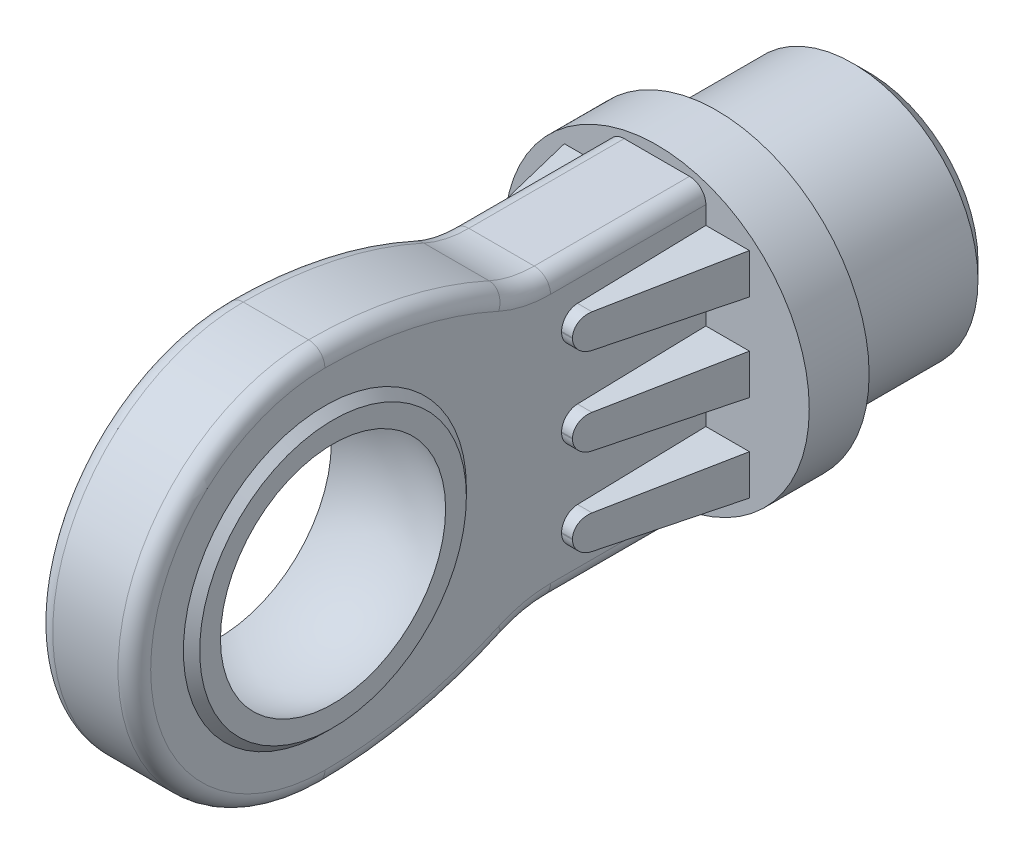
ISO-10303-21;
HEADER;
FILE_DESCRIPTION(('STEP AP214'),'2;1');
FILE_NAME('part.step','',(''),(''),'','','');
FILE_SCHEMA(('AUTOMOTIVE_DESIGN { 1 0 10303 214 1 1 1 1 }'));
ENDSEC;
DATA;
#1=APPLICATION_CONTEXT('core data for automotive mechanical design processes');
#2=APPLICATION_PROTOCOL_DEFINITION('international standard','automotive_design',2000,#1);
#3=PRODUCT_CONTEXT('',#1,'mechanical');
#4=PRODUCT('Part','Part','',(#3));
#5=PRODUCT_RELATED_PRODUCT_CATEGORY('part','',(#4));
#6=PRODUCT_DEFINITION_FORMATION('','',#4);
#7=PRODUCT_DEFINITION_CONTEXT('part definition',#1,'design');
#8=PRODUCT_DEFINITION('design','',#6,#7);
#9=PRODUCT_DEFINITION_SHAPE('','',#8);
#10=(LENGTH_UNIT() NAMED_UNIT(*) SI_UNIT(.MILLI.,.METRE.));
#11=(NAMED_UNIT(*) PLANE_ANGLE_UNIT() SI_UNIT($,.RADIAN.));
#12=(NAMED_UNIT(*) SI_UNIT($,.STERADIAN.) SOLID_ANGLE_UNIT());
#13=UNCERTAINTY_MEASURE_WITH_UNIT(LENGTH_MEASURE(1.E-05),#10,'distance_accuracy_value','');
#14=(GEOMETRIC_REPRESENTATION_CONTEXT(3) GLOBAL_UNCERTAINTY_ASSIGNED_CONTEXT((#13)) GLOBAL_UNIT_ASSIGNED_CONTEXT((#10,
#11,#12)) REPRESENTATION_CONTEXT('',''));
#15=CARTESIAN_POINT('',(0.,0.,0.));
#16=DIRECTION('',(0.,0.,1.));
#17=DIRECTION('',(1.,0.,0.));
#18=AXIS2_PLACEMENT_3D('',#15,#16,#17);
#19=CARTESIAN_POINT('',(0.,0.,5.5));
#20=DIRECTION('',(0.,0.,1.));
#21=DIRECTION('',(1.,0.,0.));
#22=AXIS2_PLACEMENT_3D('',#19,#20,#21);
#23=PLANE('',#22);
#24=DIRECTION('',(1.,0.,0.));
#25=VECTOR('',#24,1.);
#26=CARTESIAN_POINT('',(0.,1.84696346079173,5.5));
#27=LINE('',#26,#25);
#28=CARTESIAN_POINT('',(-8.5,1.84696346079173,5.5));
#29=VERTEX_POINT('',#28);
#30=CARTESIAN_POINT('',(-4.5,1.84696346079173,5.5));
#31=VERTEX_POINT('',#30);
#32=EDGE_CURVE('E388',#29,#31,#27,.T.);
#33=ORIENTED_EDGE('',*,*,#32,.T.);
#34=DIRECTION('',(0.,1.,0.));
#35=VECTOR('',#34,1.);
#36=CARTESIAN_POINT('',(-4.5,13.,5.5));
#37=LINE('',#36,#35);
#38=CARTESIAN_POINT('',(-4.5,6.15303653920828,5.49999999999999));
#39=VERTEX_POINT('',#38);
#40=EDGE_CURVE('E550',#31,#39,#37,.T.);
#41=ORIENTED_EDGE('',*,*,#40,.T.);
#42=DIRECTION('',(1.,0.,0.));
#43=VECTOR('',#42,1.);
#44=CARTESIAN_POINT('',(0.,6.15303653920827,5.5));
#45=LINE('',#44,#43);
#46=CARTESIAN_POINT('',(-8.5,6.15303653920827,5.5));
#47=VERTEX_POINT('',#46);
#48=EDGE_CURVE('E441',#47,#39,#45,.T.);
#49=ORIENTED_EDGE('',*,*,#48,.F.);
#50=DIRECTION('',(0.,-1.,0.));
#51=VECTOR('',#50,1.);
#52=CARTESIAN_POINT('',(-8.5,0.,5.5));
#53=LINE('',#52,#51);
#54=CARTESIAN_POINT('',(-8.5,9.84696346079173,5.5));
#55=VERTEX_POINT('',#54);
#56=EDGE_CURVE('E447',#47,#55,#53,.F.);
#57=ORIENTED_EDGE('',*,*,#56,.T.);
#58=DIRECTION('',(1.,0.,0.));
#59=VECTOR('',#58,1.);
#60=CARTESIAN_POINT('',(0.,9.84696346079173,5.5));
#61=LINE('',#60,#59);
#62=CARTESIAN_POINT('',(-4.5,9.84696346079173,5.5));
#63=VERTEX_POINT('',#62);
#64=EDGE_CURVE('E423',#55,#63,#61,.T.);
#65=ORIENTED_EDGE('',*,*,#64,.T.);
#66=CARTESIAN_POINT('',(-4.5,11.5,5.5));
#67=VERTEX_POINT('',#66);
#68=EDGE_CURVE('E545',#63,#67,#37,.T.);
#69=ORIENTED_EDGE('',*,*,#68,.T.);
#70=CARTESIAN_POINT('',(-3.,11.5,5.5));
#71=DIRECTION('',(0.,0.,1.));
#72=DIRECTION('',(1.,0.,0.));
#73=AXIS2_PLACEMENT_3D('',#70,#71,#72);
#74=CIRCLE('',#73,1.5);
#75=CARTESIAN_POINT('',(-3.,13.,5.5));
#76=VERTEX_POINT('',#75);
#77=EDGE_CURVE('E684',#67,#76,#74,.F.);
#78=ORIENTED_EDGE('',*,*,#77,.T.);
#79=DIRECTION('',(-1.,0.,0.));
#80=VECTOR('',#79,1.);
#81=CARTESIAN_POINT('',(4.5,13.,5.5));
#82=LINE('',#81,#80);
#83=CARTESIAN_POINT('',(3.,13.,5.5));
#84=VERTEX_POINT('',#83);
#85=EDGE_CURVE('E599',#84,#76,#82,.T.);
#86=ORIENTED_EDGE('',*,*,#85,.F.);
#87=CARTESIAN_POINT('',(3.,11.5,5.5));
#88=DIRECTION('',(0.,0.,1.));
#89=DIRECTION('',(1.,0.,0.));
#90=AXIS2_PLACEMENT_3D('',#87,#88,#89);
#91=CIRCLE('',#90,1.5);
#92=CARTESIAN_POINT('',(4.5,11.5,5.5));
#93=VERTEX_POINT('',#92);
#94=EDGE_CURVE('E646',#84,#93,#91,.F.);
#95=ORIENTED_EDGE('',*,*,#94,.T.);
#96=DIRECTION('',(0.,1.,0.));
#97=VECTOR('',#96,1.);
#98=CARTESIAN_POINT('',(4.5,13.,5.5));
#99=LINE('',#98,#97);
#100=CARTESIAN_POINT('',(4.5,9.84696346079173,5.5));
#101=VERTEX_POINT('',#100);
#102=EDGE_CURVE('E573',#101,#93,#99,.T.);
#103=ORIENTED_EDGE('',*,*,#102,.F.);
#104=DIRECTION('',(-1.,0.,0.));
#105=VECTOR('',#104,1.);
#106=CARTESIAN_POINT('',(0.,9.84696346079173,5.5));
#107=LINE('',#106,#105);
#108=CARTESIAN_POINT('',(8.5,9.84696346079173,5.5));
#109=VERTEX_POINT('',#108);
#110=EDGE_CURVE('E464',#109,#101,#107,.T.);
#111=ORIENTED_EDGE('',*,*,#110,.F.);
#112=DIRECTION('',(0.,-1.,0.));
#113=VECTOR('',#112,1.);
#114=CARTESIAN_POINT('',(8.5,0.,5.5));
#115=LINE('',#114,#113);
#116=CARTESIAN_POINT('',(8.5,6.15303653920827,5.5));
#117=VERTEX_POINT('',#116);
#118=EDGE_CURVE('E472',#117,#109,#115,.F.);
#119=ORIENTED_EDGE('',*,*,#118,.F.);
#120=DIRECTION('',(-1.,0.,0.));
#121=VECTOR('',#120,1.);
#122=CARTESIAN_POINT('',(0.,6.15303653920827,5.5));
#123=LINE('',#122,#121);
#124=CARTESIAN_POINT('',(4.5,6.15303653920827,5.5));
#125=VERTEX_POINT('',#124);
#126=EDGE_CURVE('E453',#117,#125,#123,.T.);
#127=ORIENTED_EDGE('',*,*,#126,.T.);
#128=CARTESIAN_POINT('',(4.5,1.84696346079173,5.5));
#129=VERTEX_POINT('',#128);
#130=EDGE_CURVE('E908',#129,#125,#99,.T.);
#131=ORIENTED_EDGE('',*,*,#130,.F.);
#132=DIRECTION('',(-1.,0.,0.));
#133=VECTOR('',#132,1.);
#134=CARTESIAN_POINT('',(0.,1.84696346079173,5.5));
#135=LINE('',#134,#133);
#136=CARTESIAN_POINT('',(8.5,1.84696346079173,5.5));
#137=VERTEX_POINT('',#136);
#138=EDGE_CURVE('E489',#137,#129,#135,.T.);
#139=ORIENTED_EDGE('',*,*,#138,.F.);
#140=DIRECTION('',(0.,-1.,0.));
#141=VECTOR('',#140,1.);
#142=CARTESIAN_POINT('',(8.5,0.,5.5));
#143=LINE('',#142,#141);
#144=CARTESIAN_POINT('',(8.5,-1.84696346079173,5.5));
#145=VERTEX_POINT('',#144);
#146=EDGE_CURVE('E688',#145,#137,#143,.F.);
#147=ORIENTED_EDGE('',*,*,#146,.F.);
#148=DIRECTION('',(-1.,0.,0.));
#149=VECTOR('',#148,1.);
#150=CARTESIAN_POINT('',(0.,-1.84696346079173,5.5));
#151=LINE('',#150,#149);
#152=CARTESIAN_POINT('',(4.5,-1.84696346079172,5.5));
#153=VERTEX_POINT('',#152);
#154=EDGE_CURVE('E478',#145,#153,#151,.T.);
#155=ORIENTED_EDGE('',*,*,#154,.T.);
#156=CARTESIAN_POINT('',(4.5,-6.15303653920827,5.5));
#157=VERTEX_POINT('',#156);
#158=EDGE_CURVE('E578',#157,#153,#99,.T.);
#159=ORIENTED_EDGE('',*,*,#158,.F.);
#160=DIRECTION('',(-1.,0.,0.));
#161=VECTOR('',#160,1.);
#162=CARTESIAN_POINT('',(0.,-6.15303653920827,5.5));
#163=LINE('',#162,#161);
#164=CARTESIAN_POINT('',(8.5,-6.15303653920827,5.5));
#165=VERTEX_POINT('',#164);
#166=EDGE_CURVE('E511',#165,#157,#163,.T.);
#167=ORIENTED_EDGE('',*,*,#166,.F.);
#168=DIRECTION('',(0.,-1.,0.));
#169=VECTOR('',#168,1.);
#170=CARTESIAN_POINT('',(8.5,0.,5.5));
#171=LINE('',#170,#169);
#172=CARTESIAN_POINT('',(8.5,-9.84696346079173,5.5));
#173=VERTEX_POINT('',#172);
#174=EDGE_CURVE('E519',#173,#165,#171,.F.);
#175=ORIENTED_EDGE('',*,*,#174,.F.);
#176=DIRECTION('',(-1.,0.,0.));
#177=VECTOR('',#176,1.);
#178=CARTESIAN_POINT('',(0.,-9.84696346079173,5.5));
#179=LINE('',#178,#177);
#180=CARTESIAN_POINT('',(4.5,-9.84696346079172,5.5));
#181=VERTEX_POINT('',#180);
#182=EDGE_CURVE('E501',#173,#181,#179,.T.);
#183=ORIENTED_EDGE('',*,*,#182,.T.);
#184=CARTESIAN_POINT('',(4.5,-11.5,5.5));
#185=VERTEX_POINT('',#184);
#186=EDGE_CURVE('E574',#185,#181,#99,.T.);
#187=ORIENTED_EDGE('',*,*,#186,.F.);
#188=CARTESIAN_POINT('',(3.,-11.5,5.5));
#189=DIRECTION('',(0.,0.,1.));
#190=DIRECTION('',(1.,0.,0.));
#191=AXIS2_PLACEMENT_3D('',#188,#189,#190);
#192=CIRCLE('',#191,1.5);
#193=CARTESIAN_POINT('',(3.,-13.,5.5));
#194=VERTEX_POINT('',#193);
#195=EDGE_CURVE('E649',#185,#194,#192,.F.);
#196=ORIENTED_EDGE('',*,*,#195,.T.);
#197=DIRECTION('',(-1.,0.,0.));
#198=VECTOR('',#197,1.);
#199=CARTESIAN_POINT('',(4.5,-13.,5.5));
#200=LINE('',#199,#198);
#201=CARTESIAN_POINT('',(-3.,-13.,5.5));
#202=VERTEX_POINT('',#201);
#203=EDGE_CURVE('E577',#194,#202,#200,.T.);
#204=ORIENTED_EDGE('',*,*,#203,.T.);
#205=CARTESIAN_POINT('',(-3.,-11.5,5.5));
#206=DIRECTION('',(0.,0.,1.));
#207=DIRECTION('',(1.,0.,0.));
#208=AXIS2_PLACEMENT_3D('',#205,#206,#207);
#209=CIRCLE('',#208,1.5);
#210=CARTESIAN_POINT('',(-4.5,-11.5,5.5));
#211=VERTEX_POINT('',#210);
#212=EDGE_CURVE('E686',#202,#211,#209,.F.);
#213=ORIENTED_EDGE('',*,*,#212,.T.);
#214=CARTESIAN_POINT('',(-4.5,-9.84696346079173,5.49999999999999));
#215=VERTEX_POINT('',#214);
#216=EDGE_CURVE('E546',#211,#215,#37,.T.);
#217=ORIENTED_EDGE('',*,*,#216,.T.);
#218=DIRECTION('',(1.,0.,0.));
#219=VECTOR('',#218,1.);
#220=CARTESIAN_POINT('',(0.,-9.84696346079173,5.5));
#221=LINE('',#220,#219);
#222=CARTESIAN_POINT('',(-8.5,-9.84696346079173,5.5));
#223=VERTEX_POINT('',#222);
#224=EDGE_CURVE('E401',#223,#215,#221,.T.);
#225=ORIENTED_EDGE('',*,*,#224,.F.);
#226=DIRECTION('',(0.,-1.,0.));
#227=VECTOR('',#226,1.);
#228=CARTESIAN_POINT('',(-8.5,0.,5.5));
#229=LINE('',#228,#227);
#230=CARTESIAN_POINT('',(-8.5,-6.15303653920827,5.5));
#231=VERTEX_POINT('',#230);
#232=EDGE_CURVE('E420',#223,#231,#229,.F.);
#233=ORIENTED_EDGE('',*,*,#232,.T.);
#234=DIRECTION('',(1.,0.,0.));
#235=VECTOR('',#234,1.);
#236=CARTESIAN_POINT('',(0.,-6.15303653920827,5.5));
#237=LINE('',#236,#235);
#238=CARTESIAN_POINT('',(-4.5,-6.15303653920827,5.5));
#239=VERTEX_POINT('',#238);
#240=EDGE_CURVE('E412',#231,#239,#237,.T.);
#241=ORIENTED_EDGE('',*,*,#240,.T.);
#242=CARTESIAN_POINT('',(-4.5,-1.84696346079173,5.49999999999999));
#243=VERTEX_POINT('',#242);
#244=EDGE_CURVE('E383',#239,#243,#37,.T.);
#245=ORIENTED_EDGE('',*,*,#244,.T.);
#246=DIRECTION('',(1.,0.,0.));
#247=VECTOR('',#246,1.);
#248=CARTESIAN_POINT('',(0.,-1.84696346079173,5.5));
#249=LINE('',#248,#247);
#250=CARTESIAN_POINT('',(-8.5,-1.84696346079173,5.5));
#251=VERTEX_POINT('',#250);
#252=EDGE_CURVE('E363',#251,#243,#249,.T.);
#253=ORIENTED_EDGE('',*,*,#252,.F.);
#254=DIRECTION('',(0.,-1.,0.));
#255=VECTOR('',#254,1.);
#256=CARTESIAN_POINT('',(-8.5,0.,5.5));
#257=LINE('',#256,#255);
#258=EDGE_CURVE('E370',#251,#29,#257,.F.);
#259=ORIENTED_EDGE('',*,*,#258,.T.);
#260=EDGE_LOOP('',(#33,#41,#49,#57,#65,#69,#78,#86,#95,#103,#111,#119,#127,#131,#139,#147,#155,
#159,#167,#175,#183,#187,#196,#204,#213,#217,#225,#233,#241,#245,#253,#259));
#261=FACE_BOUND('',#260,.T.);
#262=CARTESIAN_POINT('',(0.,0.,5.5));
#263=DIRECTION('',(0.,0.,1.));
#264=DIRECTION('',(1.,0.,0.));
#265=AXIS2_PLACEMENT_3D('',#262,#263,#264);
#266=CIRCLE('',#265,14.);
#267=CARTESIAN_POINT('',(14.,0.,5.5));
#268=VERTEX_POINT('',#267);
#269=EDGE_CURVE('E605',#268,#268,#266,.T.);
#270=ORIENTED_EDGE('',*,*,#269,.T.);
#271=EDGE_LOOP('',(#270));
#272=FACE_BOUND('',#271,.T.);
#273=ADVANCED_FACE('F29',(#261,#272),#23,.T.);
#274=CARTESIAN_POINT('',(-4.5,-23.,19.7695875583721));
#275=DIRECTION('',(-1.,0.,0.));
#276=DIRECTION('',(0.,0.,-1.));
#277=AXIS2_PLACEMENT_3D('',#274,#275,#276);
#278=PLANE('',#277);
#279=DIRECTION('',(0.,-0.0261769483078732,0.999657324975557));
#280=VECTOR('',#279,1.);
#281=CARTESIAN_POINT('',(-4.5,1.45653125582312,20.4100043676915));
#282=LINE('',#281,#280);
#283=CARTESIAN_POINT('',(-4.5,1.53825068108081,17.2892654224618));
#284=VERTEX_POINT('',#283);
#285=EDGE_CURVE('E395',#31,#284,#282,.T.);
#286=ORIENTED_EDGE('',*,*,#285,.T.);
#287=CARTESIAN_POINT('',(-4.5,0.0387646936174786,17.25));
#288=DIRECTION('',(-1.,0.,0.));
#289=DIRECTION('',(0.,0.,1.));
#290=AXIS2_PLACEMENT_3D('',#287,#288,#289);
#291=CIRCLE('',#290,1.5);
#292=CARTESIAN_POINT('',(-4.5,0.0387646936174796,18.75));
#293=VERTEX_POINT('',#292);
#294=EDGE_CURVE('E779',#284,#293,#291,.F.);
#295=ORIENTED_EDGE('',*,*,#294,.T.);
#296=DIRECTION('',(0.,1.,0.));
#297=VECTOR('',#296,1.);
#298=CARTESIAN_POINT('',(-4.5,-23.,18.75));
#299=LINE('',#298,#297);
#300=CARTESIAN_POINT('',(-4.5,-0.0387646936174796,18.75));
#301=VERTEX_POINT('',#300);
#302=EDGE_CURVE('E384',#293,#301,#299,.F.);
#303=ORIENTED_EDGE('',*,*,#302,.T.);
#304=CARTESIAN_POINT('',(-4.5,-0.0387646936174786,17.25));
#305=DIRECTION('',(-1.,0.,0.));
#306=DIRECTION('',(0.,0.,1.));
#307=AXIS2_PLACEMENT_3D('',#304,#305,#306);
#308=CIRCLE('',#307,1.5);
#309=CARTESIAN_POINT('',(-4.5,-1.53825068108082,17.2892654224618));
#310=VERTEX_POINT('',#309);
#311=EDGE_CURVE('E777',#301,#310,#308,.F.);
#312=ORIENTED_EDGE('',*,*,#311,.T.);
#313=DIRECTION('',(0.,0.0261769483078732,0.999657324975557));
#314=VECTOR('',#313,1.);
#315=CARTESIAN_POINT('',(-4.5,-1.48805195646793,19.2062773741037));
#316=LINE('',#315,#314);
#317=EDGE_CURVE('E385',#243,#310,#316,.T.);
#318=ORIENTED_EDGE('',*,*,#317,.F.);
#319=ORIENTED_EDGE('',*,*,#244,.F.);
#320=DIRECTION('',(0.,-0.0261769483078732,0.999657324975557));
#321=VECTOR('',#320,1.);
#322=CARTESIAN_POINT('',(-4.5,-6.53798688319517,20.2006605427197));
#323=LINE('',#322,#321);
#324=CARTESIAN_POINT('',(-4.5,-6.46174931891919,17.2892654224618));
#325=VERTEX_POINT('',#324);
#326=EDGE_CURVE('E414',#239,#325,#323,.T.);
#327=ORIENTED_EDGE('',*,*,#326,.T.);
#328=CARTESIAN_POINT('',(-4.5,-7.96123530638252,17.25));
#329=DIRECTION('',(-1.,0.,0.));
#330=DIRECTION('',(0.,0.,1.));
#331=AXIS2_PLACEMENT_3D('',#328,#329,#330);
#332=CIRCLE('',#331,1.5);
#333=CARTESIAN_POINT('',(-4.5,-7.96123530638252,18.75));
#334=VERTEX_POINT('',#333);
#335=EDGE_CURVE('E775',#325,#334,#332,.F.);
#336=ORIENTED_EDGE('',*,*,#335,.T.);
#337=DIRECTION('',(0.,1.,0.));
#338=VECTOR('',#337,1.);
#339=CARTESIAN_POINT('',(-4.5,-23.,18.75));
#340=LINE('',#339,#338);
#341=CARTESIAN_POINT('',(-4.5,-8.03876469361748,18.75));
#342=VERTEX_POINT('',#341);
#343=EDGE_CURVE('E406',#334,#342,#340,.F.);
#344=ORIENTED_EDGE('',*,*,#343,.T.);
#345=CARTESIAN_POINT('',(-4.5,-8.03876469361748,17.25));
#346=DIRECTION('',(-1.,0.,0.));
#347=DIRECTION('',(0.,0.,1.));
#348=AXIS2_PLACEMENT_3D('',#345,#346,#347);
#349=CIRCLE('',#348,1.5);
#350=CARTESIAN_POINT('',(-4.5,-9.53825068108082,17.2892654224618));
#351=VERTEX_POINT('',#350);
#352=EDGE_CURVE('E773',#342,#351,#349,.F.);
#353=ORIENTED_EDGE('',*,*,#352,.T.);
#354=DIRECTION('',(0.,0.0261769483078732,0.999657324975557));
#355=VECTOR('',#354,1.);
#356=CARTESIAN_POINT('',(-4.5,-9.48257009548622,19.4156211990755));
#357=LINE('',#356,#355);
#358=EDGE_CURVE('E398',#215,#351,#357,.T.);
#359=ORIENTED_EDGE('',*,*,#358,.F.);
#360=ORIENTED_EDGE('',*,*,#216,.F.);
#361=DIRECTION('',(0.,0.,-1.));
#362=VECTOR('',#361,1.);
#363=CARTESIAN_POINT('',(-4.5,-11.5,19.7695875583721));
#364=LINE('',#363,#362);
#365=CARTESIAN_POINT('',(-4.5,-11.5,19.7695875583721));
#366=VERTEX_POINT('',#365);
#367=EDGE_CURVE('E659',#211,#366,#364,.F.);
#368=ORIENTED_EDGE('',*,*,#367,.T.);
#369=CARTESIAN_POINT('',(-4.5,-23.,19.7695875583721));
#370=DIRECTION('',(-1.,0.,0.));
#371=DIRECTION('',(0.,0.,1.));
#372=AXIS2_PLACEMENT_3D('',#369,#370,#371);
#373=CIRCLE('',#372,11.5);
#374=CARTESIAN_POINT('',(-4.5,-12.535,24.5375824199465));
#375=VERTEX_POINT('',#374);
#376=EDGE_CURVE('E657',#366,#375,#373,.F.);
#377=ORIENTED_EDGE('',*,*,#376,.T.);
#378=CARTESIAN_POINT('',(-4.5,22.5,40.5));
#379=DIRECTION('',(-1.,0.,0.));
#380=DIRECTION('',(0.,0.,1.));
#381=AXIS2_PLACEMENT_3D('',#378,#379,#380);
#382=CIRCLE('',#381,38.5);
#383=CARTESIAN_POINT('',(-4.5,-16.,40.5));
#384=VERTEX_POINT('',#383);
#385=EDGE_CURVE('E661',#375,#384,#382,.T.);
#386=ORIENTED_EDGE('',*,*,#385,.T.);
#387=CARTESIAN_POINT('',(-4.5,0.,40.5));
#388=DIRECTION('',(-1.,0.,0.));
#389=DIRECTION('',(0.,0.,1.));
#390=AXIS2_PLACEMENT_3D('',#387,#388,#389);
#391=CIRCLE('',#390,16.);
#392=CARTESIAN_POINT('',(-4.5,16.,40.5));
#393=VERTEX_POINT('',#392);
#394=EDGE_CURVE('E663',#384,#393,#391,.T.);
#395=ORIENTED_EDGE('',*,*,#394,.T.);
#396=CARTESIAN_POINT('',(-4.5,-22.5,40.5));
#397=DIRECTION('',(-1.,0.,0.));
#398=DIRECTION('',(0.,0.,1.));
#399=AXIS2_PLACEMENT_3D('',#396,#397,#398);
#400=CIRCLE('',#399,38.5);
#401=CARTESIAN_POINT('',(-4.5,12.535,24.5375824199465));
#402=VERTEX_POINT('',#401);
#403=EDGE_CURVE('E665',#393,#402,#400,.T.);
#404=ORIENTED_EDGE('',*,*,#403,.T.);
#405=CARTESIAN_POINT('',(-4.5,23.,19.7695875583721));
#406=DIRECTION('',(-1.,0.,0.));
#407=DIRECTION('',(0.,0.,1.));
#408=AXIS2_PLACEMENT_3D('',#405,#406,#407);
#409=CIRCLE('',#408,11.5);
#410=CARTESIAN_POINT('',(-4.5,11.5,19.7695875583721));
#411=VERTEX_POINT('',#410);
#412=EDGE_CURVE('E667',#402,#411,#409,.F.);
#413=ORIENTED_EDGE('',*,*,#412,.T.);
#414=DIRECTION('',(0.,0.,1.));
#415=VECTOR('',#414,1.);
#416=CARTESIAN_POINT('',(-4.5,11.5,5.5));
#417=LINE('',#416,#415);
#418=EDGE_CURVE('E669',#411,#67,#417,.F.);
#419=ORIENTED_EDGE('',*,*,#418,.T.);
#420=ORIENTED_EDGE('',*,*,#68,.F.);
#421=DIRECTION('',(0.,-0.0261769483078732,0.999657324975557));
#422=VECTOR('',#421,1.);
#423=CARTESIAN_POINT('',(-4.5,9.45104939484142,20.6193481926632));
#424=LINE('',#423,#422);
#425=CARTESIAN_POINT('',(-4.5,9.53825068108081,17.2892654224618));
#426=VERTEX_POINT('',#425);
#427=EDGE_CURVE('E426',#63,#426,#424,.T.);
#428=ORIENTED_EDGE('',*,*,#427,.T.);
#429=CARTESIAN_POINT('',(-4.5,8.03876469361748,17.25));
#430=DIRECTION('',(-1.,0.,0.));
#431=DIRECTION('',(0.,0.,1.));
#432=AXIS2_PLACEMENT_3D('',#429,#430,#431);
#433=CIRCLE('',#432,1.5);
#434=CARTESIAN_POINT('',(-4.5,8.03876469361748,18.75));
#435=VERTEX_POINT('',#434);
#436=EDGE_CURVE('E783',#426,#435,#433,.F.);
#437=ORIENTED_EDGE('',*,*,#436,.T.);
#438=DIRECTION('',(0.,1.,0.));
#439=VECTOR('',#438,1.);
#440=CARTESIAN_POINT('',(-4.5,-23.,18.75));
#441=LINE('',#440,#439);
#442=CARTESIAN_POINT('',(-4.5,7.96123530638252,18.75));
#443=VERTEX_POINT('',#442);
#444=EDGE_CURVE('E432',#435,#443,#441,.F.);
#445=ORIENTED_EDGE('',*,*,#444,.T.);
#446=CARTESIAN_POINT('',(-4.5,7.96123530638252,17.25));
#447=DIRECTION('',(-1.,0.,0.));
#448=DIRECTION('',(0.,0.,1.));
#449=AXIS2_PLACEMENT_3D('',#446,#447,#448);
#450=CIRCLE('',#449,1.5);
#451=CARTESIAN_POINT('',(-4.5,6.46174931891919,17.2892654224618));
#452=VERTEX_POINT('',#451);
#453=EDGE_CURVE('E781',#443,#452,#450,.F.);
#454=ORIENTED_EDGE('',*,*,#453,.T.);
#455=DIRECTION('',(0.,0.0261769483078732,0.999657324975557));
#456=VECTOR('',#455,1.);
#457=CARTESIAN_POINT('',(-4.5,6.50646618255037,18.996933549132));
#458=LINE('',#457,#456);
#459=EDGE_CURVE('E438',#39,#452,#458,.T.);
#460=ORIENTED_EDGE('',*,*,#459,.F.);
#461=ORIENTED_EDGE('',*,*,#40,.F.);
#462=EDGE_LOOP('',(#286,#295,#303,#312,#318,#319,#327,#336,#344,#353,#359,#360,#368,#377,#386,
#395,#404,#413,#419,#420,#428,#437,#445,#454,#460,#461));
#463=FACE_BOUND('',#462,.T.);
#464=CARTESIAN_POINT('',(-4.5,0.,40.5));
#465=DIRECTION('',(-1.,0.,0.));
#466=DIRECTION('',(0.,0.,1.));
#467=AXIS2_PLACEMENT_3D('',#464,#465,#466);
#468=CIRCLE('',#467,13.);
#469=CARTESIAN_POINT('',(-4.5,0.,53.5));
#470=VERTEX_POINT('',#469);
#471=EDGE_CURVE('E651',#470,#470,#468,.T.);
#472=ORIENTED_EDGE('',*,*,#471,.F.);
#473=EDGE_LOOP('',(#472));
#474=FACE_BOUND('',#473,.T.);
#475=ADVANCED_FACE('F845',(#463,#474),#278,.T.);
#476=CARTESIAN_POINT('',(5.25,0.,40.5));
#477=DIRECTION('',(1.,0.,0.));
#478=DIRECTION('',(0.,0.,-1.));
#479=AXIS2_PLACEMENT_3D('',#476,#477,#478);
#480=PLANE('',#479);
#481=CARTESIAN_POINT('',(5.25,0.,40.5));
#482=DIRECTION('',(1.,0.,0.));
#483=DIRECTION('',(0.,0.,-1.));
#484=AXIS2_PLACEMENT_3D('',#481,#482,#483);
#485=CIRCLE('',#484,12.25);
#486=CARTESIAN_POINT('',(5.25,0.,28.25));
#487=VERTEX_POINT('',#486);
#488=EDGE_CURVE('E570',#487,#487,#485,.T.);
#489=ORIENTED_EDGE('',*,*,#488,.T.);
#490=EDGE_LOOP('',(#489));
#491=FACE_BOUND('',#490,.T.);
#492=CARTESIAN_POINT('',(5.25,0.,40.5));
#493=DIRECTION('',(1.,0.,0.));
#494=DIRECTION('',(0.,0.,-1.));
#495=AXIS2_PLACEMENT_3D('',#492,#493,#494);
#496=CIRCLE('',#495,10.3439595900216);
#497=CARTESIAN_POINT('',(5.25,0.,30.1560404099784));
#498=VERTEX_POINT('',#497);
#499=EDGE_CURVE('E522',#498,#498,#496,.F.);
#500=ORIENTED_EDGE('',*,*,#499,.T.);
#501=EDGE_LOOP('',(#500));
#502=FACE_BOUND('',#501,.T.);
#503=ADVANCED_FACE('F975',(#491,#502),#480,.T.);
#504=CARTESIAN_POINT('',(-5.25,0.,40.5));
#505=DIRECTION('',(-1.,0.,0.));
#506=DIRECTION('',(0.,0.,-1.));
#507=AXIS2_PLACEMENT_3D('',#504,#505,#506);
#508=PLANE('',#507);
#509=CARTESIAN_POINT('',(-5.25,0.,40.5));
#510=DIRECTION('',(-1.,0.,0.));
#511=DIRECTION('',(0.,0.,1.));
#512=AXIS2_PLACEMENT_3D('',#509,#510,#511);
#513=CIRCLE('',#512,12.25);
#514=CARTESIAN_POINT('',(-5.25,0.,52.75));
#515=VERTEX_POINT('',#514);
#516=EDGE_CURVE('E542',#515,#515,#513,.F.);
#517=ORIENTED_EDGE('',*,*,#516,.F.);
#518=EDGE_LOOP('',(#517));
#519=FACE_BOUND('',#518,.T.);
#520=CARTESIAN_POINT('',(-5.25,0.,40.5));
#521=DIRECTION('',(-1.,0.,0.));
#522=DIRECTION('',(0.,0.,1.));
#523=AXIS2_PLACEMENT_3D('',#520,#521,#522);
#524=CIRCLE('',#523,10.3439595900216);
#525=CARTESIAN_POINT('',(-5.25,0.,50.8439595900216));
#526=VERTEX_POINT('',#525);
#527=EDGE_CURVE('E521',#526,#526,#524,.F.);
#528=ORIENTED_EDGE('',*,*,#527,.T.);
#529=EDGE_LOOP('',(#528));
#530=FACE_BOUND('',#529,.T.);
#531=ADVANCED_FACE('F1025',(#519,#530),#508,.T.);
#532=CARTESIAN_POINT('',(4.5,-23.,19.7695875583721));
#533=DIRECTION('',(1.,0.,0.));
#534=DIRECTION('',(0.,0.,-1.));
#535=AXIS2_PLACEMENT_3D('',#532,#533,#534);
#536=PLANE('',#535);
#537=DIRECTION('',(0.,-0.0261769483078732,0.999657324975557));
#538=VECTOR('',#537,1.);
#539=CARTESIAN_POINT('',(4.5,9.45104939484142,20.6193481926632));
#540=LINE('',#539,#538);
#541=CARTESIAN_POINT('',(4.5,9.53825068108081,17.2892654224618));
#542=VERTEX_POINT('',#541);
#543=EDGE_CURVE('E466',#101,#542,#540,.T.);
#544=ORIENTED_EDGE('',*,*,#543,.F.);
#545=ORIENTED_EDGE('',*,*,#102,.T.);
#546=DIRECTION('',(0.,0.,1.));
#547=VECTOR('',#546,1.);
#548=CARTESIAN_POINT('',(4.5,11.5,19.7695875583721));
#549=LINE('',#548,#547);
#550=CARTESIAN_POINT('',(4.5,11.5,19.7695875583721));
#551=VERTEX_POINT('',#550);
#552=EDGE_CURVE('E629',#93,#551,#549,.T.);
#553=ORIENTED_EDGE('',*,*,#552,.T.);
#554=CARTESIAN_POINT('',(4.5,23.,19.7695875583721));
#555=DIRECTION('',(1.,0.,0.));
#556=DIRECTION('',(0.,0.,-1.));
#557=AXIS2_PLACEMENT_3D('',#554,#555,#556);
#558=CIRCLE('',#557,11.5);
#559=CARTESIAN_POINT('',(4.5,12.535,24.5375824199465));
#560=VERTEX_POINT('',#559);
#561=EDGE_CURVE('E627',#551,#560,#558,.F.);
#562=ORIENTED_EDGE('',*,*,#561,.T.);
#563=CARTESIAN_POINT('',(4.5,-22.5,40.5));
#564=DIRECTION('',(1.,0.,0.));
#565=DIRECTION('',(0.,0.,-1.));
#566=AXIS2_PLACEMENT_3D('',#563,#564,#565);
#567=CIRCLE('',#566,38.5);
#568=CARTESIAN_POINT('',(4.5,16.,40.5));
#569=VERTEX_POINT('',#568);
#570=EDGE_CURVE('E625',#560,#569,#567,.T.);
#571=ORIENTED_EDGE('',*,*,#570,.T.);
#572=CARTESIAN_POINT('',(4.5,0.,40.5));
#573=DIRECTION('',(1.,0.,0.));
#574=DIRECTION('',(0.,0.,-1.));
#575=AXIS2_PLACEMENT_3D('',#572,#573,#574);
#576=CIRCLE('',#575,16.);
#577=CARTESIAN_POINT('',(4.5,-16.,40.5));
#578=VERTEX_POINT('',#577);
#579=EDGE_CURVE('E623',#569,#578,#576,.T.);
#580=ORIENTED_EDGE('',*,*,#579,.T.);
#581=CARTESIAN_POINT('',(4.5,22.5,40.5));
#582=DIRECTION('',(1.,0.,0.));
#583=DIRECTION('',(0.,0.,-1.));
#584=AXIS2_PLACEMENT_3D('',#581,#582,#583);
#585=CIRCLE('',#584,38.5);
#586=CARTESIAN_POINT('',(4.5,-12.535,24.5375824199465));
#587=VERTEX_POINT('',#586);
#588=EDGE_CURVE('E621',#578,#587,#585,.T.);
#589=ORIENTED_EDGE('',*,*,#588,.T.);
#590=CARTESIAN_POINT('',(4.5,-23.,19.7695875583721));
#591=DIRECTION('',(1.,0.,0.));
#592=DIRECTION('',(0.,0.,-1.));
#593=AXIS2_PLACEMENT_3D('',#590,#591,#592);
#594=CIRCLE('',#593,11.5);
#595=CARTESIAN_POINT('',(4.5,-11.5,19.7695875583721));
#596=VERTEX_POINT('',#595);
#597=EDGE_CURVE('E617',#587,#596,#594,.F.);
#598=ORIENTED_EDGE('',*,*,#597,.T.);
#599=DIRECTION('',(0.,0.,-1.));
#600=VECTOR('',#599,1.);
#601=CARTESIAN_POINT('',(4.5,-11.5,5.5));
#602=LINE('',#601,#600);
#603=EDGE_CURVE('E619',#596,#185,#602,.T.);
#604=ORIENTED_EDGE('',*,*,#603,.T.);
#605=ORIENTED_EDGE('',*,*,#186,.T.);
#606=DIRECTION('',(0.,0.0261769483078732,0.999657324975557));
#607=VECTOR('',#606,1.);
#608=CARTESIAN_POINT('',(4.5,-9.48257009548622,19.4156211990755));
#609=LINE('',#608,#607);
#610=CARTESIAN_POINT('',(4.5,-9.53825068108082,17.2892654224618));
#611=VERTEX_POINT('',#610);
#612=EDGE_CURVE('E508',#181,#611,#609,.T.);
#613=ORIENTED_EDGE('',*,*,#612,.T.);
#614=CARTESIAN_POINT('',(4.5,-8.03876469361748,17.25));
#615=DIRECTION('',(1.,0.,0.));
#616=DIRECTION('',(0.,0.,-1.));
#617=AXIS2_PLACEMENT_3D('',#614,#615,#616);
#618=CIRCLE('',#617,1.5);
#619=CARTESIAN_POINT('',(4.5,-8.03876469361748,18.75));
#620=VERTEX_POINT('',#619);
#621=EDGE_CURVE('E11',#611,#620,#618,.F.);
#622=ORIENTED_EDGE('',*,*,#621,.T.);
#623=DIRECTION('',(0.,1.,0.));
#624=VECTOR('',#623,1.);
#625=CARTESIAN_POINT('',(4.5,-23.,18.75));
#626=LINE('',#625,#624);
#627=CARTESIAN_POINT('',(4.5,-7.96123530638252,18.75));
#628=VERTEX_POINT('',#627);
#629=EDGE_CURVE('E516',#628,#620,#626,.F.);
#630=ORIENTED_EDGE('',*,*,#629,.F.);
#631=CARTESIAN_POINT('',(4.5,-7.96123530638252,17.25));
#632=DIRECTION('',(1.,0.,0.));
#633=DIRECTION('',(0.,0.,-1.));
#634=AXIS2_PLACEMENT_3D('',#631,#632,#633);
#635=CIRCLE('',#634,1.5);
#636=CARTESIAN_POINT('',(4.5,-6.46174931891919,17.2892654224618));
#637=VERTEX_POINT('',#636);
#638=EDGE_CURVE('E37',#628,#637,#635,.F.);
#639=ORIENTED_EDGE('',*,*,#638,.T.);
#640=DIRECTION('',(0.,-0.0261769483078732,0.999657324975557));
#641=VECTOR('',#640,1.);
#642=CARTESIAN_POINT('',(4.5,-6.53798688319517,20.2006605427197));
#643=LINE('',#642,#641);
#644=EDGE_CURVE('E513',#157,#637,#643,.T.);
#645=ORIENTED_EDGE('',*,*,#644,.F.);
#646=ORIENTED_EDGE('',*,*,#158,.T.);
#647=DIRECTION('',(0.,0.0261769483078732,0.999657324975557));
#648=VECTOR('',#647,1.);
#649=CARTESIAN_POINT('',(4.5,-1.48805195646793,19.2062773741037));
#650=LINE('',#649,#648);
#651=CARTESIAN_POINT('',(4.5,-1.53825068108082,17.2892654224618));
#652=VERTEX_POINT('',#651);
#653=EDGE_CURVE('E486',#153,#652,#650,.T.);
#654=ORIENTED_EDGE('',*,*,#653,.T.);
#655=CARTESIAN_POINT('',(4.5,-0.0387646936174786,17.25));
#656=DIRECTION('',(1.,0.,0.));
#657=DIRECTION('',(0.,0.,-1.));
#658=AXIS2_PLACEMENT_3D('',#655,#656,#657);
#659=CIRCLE('',#658,1.5);
#660=CARTESIAN_POINT('',(4.5,-0.0387646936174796,18.75));
#661=VERTEX_POINT('',#660);
#662=EDGE_CURVE('E791',#652,#661,#659,.F.);
#663=ORIENTED_EDGE('',*,*,#662,.T.);
#664=DIRECTION('',(0.,1.,0.));
#665=VECTOR('',#664,1.);
#666=CARTESIAN_POINT('',(4.5,-23.,18.75));
#667=LINE('',#666,#665);
#668=CARTESIAN_POINT('',(4.5,0.0387646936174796,18.75));
#669=VERTEX_POINT('',#668);
#670=EDGE_CURVE('E494',#669,#661,#667,.F.);
#671=ORIENTED_EDGE('',*,*,#670,.F.);
#672=CARTESIAN_POINT('',(4.5,0.0387646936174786,17.25));
#673=DIRECTION('',(1.,0.,0.));
#674=DIRECTION('',(0.,0.,-1.));
#675=AXIS2_PLACEMENT_3D('',#672,#673,#674);
#676=CIRCLE('',#675,1.5);
#677=CARTESIAN_POINT('',(4.5,1.53825068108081,17.2892654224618));
#678=VERTEX_POINT('',#677);
#679=EDGE_CURVE('E789',#669,#678,#676,.F.);
#680=ORIENTED_EDGE('',*,*,#679,.T.);
#681=DIRECTION('',(0.,-0.0261769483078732,0.999657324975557));
#682=VECTOR('',#681,1.);
#683=CARTESIAN_POINT('',(4.5,1.45653125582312,20.4100043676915));
#684=LINE('',#683,#682);
#685=EDGE_CURVE('E491',#129,#678,#684,.T.);
#686=ORIENTED_EDGE('',*,*,#685,.F.);
#687=ORIENTED_EDGE('',*,*,#130,.T.);
#688=DIRECTION('',(0.,0.0261769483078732,0.999657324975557));
#689=VECTOR('',#688,1.);
#690=CARTESIAN_POINT('',(4.5,6.50646618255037,18.996933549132));
#691=LINE('',#690,#689);
#692=CARTESIAN_POINT('',(4.5,6.46174931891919,17.2892654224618));
#693=VERTEX_POINT('',#692);
#694=EDGE_CURVE('E461',#125,#693,#691,.T.);
#695=ORIENTED_EDGE('',*,*,#694,.T.);
#696=CARTESIAN_POINT('',(4.5,7.96123530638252,17.25));
#697=DIRECTION('',(1.,0.,0.));
#698=DIRECTION('',(0.,0.,-1.));
#699=AXIS2_PLACEMENT_3D('',#696,#697,#698);
#700=CIRCLE('',#699,1.5);
#701=CARTESIAN_POINT('',(4.5,7.96123530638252,18.75));
#702=VERTEX_POINT('',#701);
#703=EDGE_CURVE('E787',#693,#702,#700,.F.);
#704=ORIENTED_EDGE('',*,*,#703,.T.);
#705=DIRECTION('',(0.,1.,0.));
#706=VECTOR('',#705,1.);
#707=CARTESIAN_POINT('',(4.5,-23.,18.75));
#708=LINE('',#707,#706);
#709=CARTESIAN_POINT('',(4.5,8.03876469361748,18.75));
#710=VERTEX_POINT('',#709);
#711=EDGE_CURVE('E469',#710,#702,#708,.F.);
#712=ORIENTED_EDGE('',*,*,#711,.F.);
#713=CARTESIAN_POINT('',(4.5,8.03876469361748,17.25));
#714=DIRECTION('',(1.,0.,0.));
#715=DIRECTION('',(0.,0.,-1.));
#716=AXIS2_PLACEMENT_3D('',#713,#714,#715);
#717=CIRCLE('',#716,1.5);
#718=EDGE_CURVE('E785',#710,#542,#717,.F.);
#719=ORIENTED_EDGE('',*,*,#718,.T.);
#720=EDGE_LOOP('',(#544,#545,#553,#562,#571,#580,#589,#598,#604,#605,#613,#622,#630,#639,#645,
#646,#654,#663,#671,#680,#686,#687,#695,#704,#712,#719));
#721=FACE_BOUND('',#720,.T.);
#722=CARTESIAN_POINT('',(4.5,0.,40.5));
#723=DIRECTION('',(1.,0.,0.));
#724=DIRECTION('',(0.,0.,-1.));
#725=AXIS2_PLACEMENT_3D('',#722,#723,#724);
#726=CIRCLE('',#725,13.);
#727=CARTESIAN_POINT('',(4.5,0.,27.5));
#728=VERTEX_POINT('',#727);
#729=EDGE_CURVE('E567',#728,#728,#726,.T.);
#730=ORIENTED_EDGE('',*,*,#729,.F.);
#731=EDGE_LOOP('',(#730));
#732=FACE_BOUND('',#731,.T.);
#733=ADVANCED_FACE('F796',(#721,#732),#536,.T.);
#734=CARTESIAN_POINT('',(0.,0.,-14.));
#735=DIRECTION('',(0.,0.,1.));
#736=DIRECTION('',(1.,0.,0.));
#737=AXIS2_PLACEMENT_3D('',#734,#735,#736);
#738=CYLINDRICAL_SURFACE('',#737,11.5);
#739=CARTESIAN_POINT('',(0.,0.,-12.5));
#740=DIRECTION('',(0.,0.,1.));
#741=DIRECTION('',(1.,0.,0.));
#742=AXIS2_PLACEMENT_3D('',#739,#740,#741);
#743=CIRCLE('',#742,11.5);
#744=CARTESIAN_POINT('',(11.5,0.,-12.5));
#745=VERTEX_POINT('',#744);
#746=EDGE_CURVE('E611',#745,#745,#743,.T.);
#747=ORIENTED_EDGE('',*,*,#746,.T.);
#748=EDGE_LOOP('',(#747));
#749=FACE_BOUND('',#748,.T.);
#750=CARTESIAN_POINT('',(0.,0.,0.));
#751=DIRECTION('',(0.,0.,1.));
#752=DIRECTION('',(1.,0.,0.));
#753=AXIS2_PLACEMENT_3D('',#750,#751,#752);
#754=CIRCLE('',#753,11.5);
#755=CARTESIAN_POINT('',(11.5,0.,0.));
#756=VERTEX_POINT('',#755);
#757=EDGE_CURVE('E608',#756,#756,#754,.T.);
#758=ORIENTED_EDGE('',*,*,#757,.F.);
#759=EDGE_LOOP('',(#758));
#760=FACE_BOUND('',#759,.T.);
#761=ADVANCED_FACE('F31',(#749,#760),#738,.T.);
#762=CARTESIAN_POINT('',(0.,0.,-14.));
#763=DIRECTION('',(0.,0.,1.));
#764=DIRECTION('',(1.,0.,0.));
#765=AXIS2_PLACEMENT_3D('',#762,#763,#764);
#766=PLANE('',#765);
#767=CARTESIAN_POINT('',(0.,0.,-14.));
#768=DIRECTION('',(0.,0.,1.));
#769=DIRECTION('',(1.,0.,0.));
#770=AXIS2_PLACEMENT_3D('',#767,#768,#769);
#771=CIRCLE('',#770,9.99999999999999);
#772=CARTESIAN_POINT('',(9.99999999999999,0.,-14.));
#773=VERTEX_POINT('',#772);
#774=EDGE_CURVE('E614',#773,#773,#771,.F.);
#775=ORIENTED_EDGE('',*,*,#774,.T.);
#776=EDGE_LOOP('',(#775));
#777=FACE_BOUND('',#776,.T.);
#778=ADVANCED_FACE('F983',(#777),#766,.F.);
#779=CARTESIAN_POINT('',(0.,0.,5.5));
#780=DIRECTION('',(0.,0.,-1.));
#781=DIRECTION('',(-1.,0.,0.));
#782=AXIS2_PLACEMENT_3D('',#779,#780,#781);
#783=CYLINDRICAL_SURFACE('',#782,14.);
#784=ORIENTED_EDGE('',*,*,#269,.F.);
#785=EDGE_LOOP('',(#784));
#786=FACE_BOUND('',#785,.T.);
#787=CARTESIAN_POINT('',(0.,0.,0.));
#788=DIRECTION('',(0.,0.,1.));
#789=DIRECTION('',(1.,0.,0.));
#790=AXIS2_PLACEMENT_3D('',#787,#788,#789);
#791=CIRCLE('',#790,14.);
#792=CARTESIAN_POINT('',(14.,0.,0.));
#793=VERTEX_POINT('',#792);
#794=EDGE_CURVE('E602',#793,#793,#791,.T.);
#795=ORIENTED_EDGE('',*,*,#794,.T.);
#796=EDGE_LOOP('',(#795));
#797=FACE_BOUND('',#796,.T.);
#798=ADVANCED_FACE('F981',(#786,#797),#783,.T.);
#799=CARTESIAN_POINT('',(0.,0.,0.));
#800=DIRECTION('',(0.,0.,1.));
#801=DIRECTION('',(1.,0.,0.));
#802=AXIS2_PLACEMENT_3D('',#799,#800,#801);
#803=PLANE('',#802);
#804=ORIENTED_EDGE('',*,*,#794,.F.);
#805=EDGE_LOOP('',(#804));
#806=FACE_BOUND('',#805,.T.);
#807=ORIENTED_EDGE('',*,*,#757,.T.);
#808=EDGE_LOOP('',(#807));
#809=FACE_BOUND('',#808,.T.);
#810=ADVANCED_FACE('F979',(#806,#809),#803,.F.);
#811=CARTESIAN_POINT('',(0.,0.,-12.5));
#812=DIRECTION('',(0.,0.,1.));
#813=DIRECTION('',(1.,0.,0.));
#814=AXIS2_PLACEMENT_3D('',#811,#812,#813);
#815=CONICAL_SURFACE('',#814,11.5,0.78539816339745);
#816=ORIENTED_EDGE('',*,*,#746,.F.);
#817=EDGE_LOOP('',(#816));
#818=FACE_BOUND('',#817,.T.);
#819=ORIENTED_EDGE('',*,*,#774,.F.);
#820=EDGE_LOOP('',(#819));
#821=FACE_BOUND('',#820,.T.);
#822=ADVANCED_FACE('F993',(#818,#821),#815,.T.);
#823=CARTESIAN_POINT('',(4.5,13.,5.5));
#824=DIRECTION('',(0.,-1.,0.));
#825=DIRECTION('',(0.,0.,-1.));
#826=AXIS2_PLACEMENT_3D('',#823,#824,#825);
#827=PLANE('',#826);
#828=ORIENTED_EDGE('',*,*,#85,.T.);
#829=DIRECTION('',(0.,0.,1.));
#830=VECTOR('',#829,1.);
#831=CARTESIAN_POINT('',(-3.,13.,19.7695875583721));
#832=LINE('',#831,#830);
#833=CARTESIAN_POINT('',(-3.,13.,19.7695875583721));
#834=VERTEX_POINT('',#833);
#835=EDGE_CURVE('E654',#76,#834,#832,.T.);
#836=ORIENTED_EDGE('',*,*,#835,.T.);
#837=DIRECTION('',(-1.,0.,0.));
#838=VECTOR('',#837,1.);
#839=CARTESIAN_POINT('',(4.5,13.,19.7695875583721));
#840=LINE('',#839,#838);
#841=CARTESIAN_POINT('',(3.,13.,19.7695875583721));
#842=VERTEX_POINT('',#841);
#843=EDGE_CURVE('E596',#842,#834,#840,.T.);
#844=ORIENTED_EDGE('',*,*,#843,.F.);
#845=DIRECTION('',(0.,0.,1.));
#846=VECTOR('',#845,1.);
#847=CARTESIAN_POINT('',(3.,13.,5.5));
#848=LINE('',#847,#846);
#849=EDGE_CURVE('E632',#842,#84,#848,.F.);
#850=ORIENTED_EDGE('',*,*,#849,.T.);
#851=EDGE_LOOP('',(#828,#836,#844,#850));
#852=FACE_BOUND('',#851,.T.);
#853=ADVANCED_FACE('F890',(#852),#827,.F.);
#854=CARTESIAN_POINT('',(4.5,23.,19.7695875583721));
#855=DIRECTION('',(-1.,0.,0.));
#856=DIRECTION('',(0.,0.,1.));
#857=AXIS2_PLACEMENT_3D('',#854,#855,#856);
#858=CYLINDRICAL_SURFACE('',#857,10.);
#859=ORIENTED_EDGE('',*,*,#843,.T.);
#860=CARTESIAN_POINT('',(-3.,23.,19.7695875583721));
#861=DIRECTION('',(-1.,0.,0.));
#862=DIRECTION('',(0.,0.,1.));
#863=AXIS2_PLACEMENT_3D('',#860,#861,#862);
#864=CIRCLE('',#863,10.);
#865=CARTESIAN_POINT('',(-3.,13.9,23.9156700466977));
#866=VERTEX_POINT('',#865);
#867=EDGE_CURVE('E672',#834,#866,#864,.T.);
#868=ORIENTED_EDGE('',*,*,#867,.T.);
#869=DIRECTION('',(-1.,0.,0.));
#870=VECTOR('',#869,1.);
#871=CARTESIAN_POINT('',(4.5,13.9,23.9156700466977));
#872=LINE('',#871,#870);
#873=CARTESIAN_POINT('',(3.,13.9,23.9156700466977));
#874=VERTEX_POINT('',#873);
#875=EDGE_CURVE('E593',#874,#866,#872,.T.);
#876=ORIENTED_EDGE('',*,*,#875,.F.);
#877=CARTESIAN_POINT('',(3.,23.,19.7695875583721));
#878=DIRECTION('',(1.,0.,0.));
#879=DIRECTION('',(0.,0.,-1.));
#880=AXIS2_PLACEMENT_3D('',#877,#878,#879);
#881=CIRCLE('',#880,10.);
#882=EDGE_CURVE('E634',#874,#842,#881,.T.);
#883=ORIENTED_EDGE('',*,*,#882,.T.);
#884=EDGE_LOOP('',(#859,#868,#876,#883));
#885=FACE_BOUND('',#884,.T.);
#886=ADVANCED_FACE('F893',(#885),#858,.F.);
#887=CARTESIAN_POINT('',(4.5,-22.5,40.5));
#888=DIRECTION('',(-1.,0.,0.));
#889=DIRECTION('',(0.,0.,1.));
#890=AXIS2_PLACEMENT_3D('',#887,#888,#889);
#891=CYLINDRICAL_SURFACE('',#890,40.);
#892=ORIENTED_EDGE('',*,*,#875,.T.);
#893=CARTESIAN_POINT('',(-3.,-22.5,40.5));
#894=DIRECTION('',(-1.,0.,0.));
#895=DIRECTION('',(0.,0.,1.));
#896=AXIS2_PLACEMENT_3D('',#893,#894,#895);
#897=CIRCLE('',#896,40.);
#898=CARTESIAN_POINT('',(-3.,17.5,40.5));
#899=VERTEX_POINT('',#898);
#900=EDGE_CURVE('E674',#866,#899,#897,.F.);
#901=ORIENTED_EDGE('',*,*,#900,.T.);
#902=DIRECTION('',(-1.,0.,0.));
#903=VECTOR('',#902,1.);
#904=CARTESIAN_POINT('',(4.5,17.5,40.5));
#905=LINE('',#904,#903);
#906=CARTESIAN_POINT('',(3.,17.5,40.5));
#907=VERTEX_POINT('',#906);
#908=EDGE_CURVE('E590',#907,#899,#905,.T.);
#909=ORIENTED_EDGE('',*,*,#908,.F.);
#910=CARTESIAN_POINT('',(3.,-22.5,40.5));
#911=DIRECTION('',(1.,0.,0.));
#912=DIRECTION('',(0.,0.,-1.));
#913=AXIS2_PLACEMENT_3D('',#910,#911,#912);
#914=CIRCLE('',#913,40.);
#915=EDGE_CURVE('E636',#907,#874,#914,.F.);
#916=ORIENTED_EDGE('',*,*,#915,.T.);
#917=EDGE_LOOP('',(#892,#901,#909,#916));
#918=FACE_BOUND('',#917,.T.);
#919=ADVANCED_FACE('F1006',(#918),#891,.T.);
#920=CARTESIAN_POINT('',(4.5,0.,40.5));
#921=DIRECTION('',(-1.,0.,0.));
#922=DIRECTION('',(0.,0.,1.));
#923=AXIS2_PLACEMENT_3D('',#920,#921,#922);
#924=CYLINDRICAL_SURFACE('',#923,17.5);
#925=ORIENTED_EDGE('',*,*,#908,.T.);
#926=CARTESIAN_POINT('',(-3.,0.,40.5));
#927=DIRECTION('',(-1.,0.,0.));
#928=DIRECTION('',(0.,0.,1.));
#929=AXIS2_PLACEMENT_3D('',#926,#927,#928);
#930=CIRCLE('',#929,17.5);
#931=CARTESIAN_POINT('',(-3.,-17.5,40.5));
#932=VERTEX_POINT('',#931);
#933=EDGE_CURVE('E676',#899,#932,#930,.F.);
#934=ORIENTED_EDGE('',*,*,#933,.T.);
#935=DIRECTION('',(-1.,0.,0.));
#936=VECTOR('',#935,1.);
#937=CARTESIAN_POINT('',(4.5,-17.5,40.5));
#938=LINE('',#937,#936);
#939=CARTESIAN_POINT('',(3.,-17.5,40.5));
#940=VERTEX_POINT('',#939);
#941=EDGE_CURVE('E587',#940,#932,#938,.T.);
#942=ORIENTED_EDGE('',*,*,#941,.F.);
#943=CARTESIAN_POINT('',(3.,0.,40.5));
#944=DIRECTION('',(1.,0.,0.));
#945=DIRECTION('',(0.,0.,-1.));
#946=AXIS2_PLACEMENT_3D('',#943,#944,#945);
#947=CIRCLE('',#946,17.5);
#948=EDGE_CURVE('E638',#940,#907,#947,.F.);
#949=ORIENTED_EDGE('',*,*,#948,.T.);
#950=EDGE_LOOP('',(#925,#934,#942,#949));
#951=FACE_BOUND('',#950,.T.);
#952=ADVANCED_FACE('F1009',(#951),#924,.T.);
#953=CARTESIAN_POINT('',(4.5,22.5,40.5));
#954=DIRECTION('',(-1.,0.,0.));
#955=DIRECTION('',(0.,0.,1.));
#956=AXIS2_PLACEMENT_3D('',#953,#954,#955);
#957=CYLINDRICAL_SURFACE('',#956,40.);
#958=ORIENTED_EDGE('',*,*,#941,.T.);
#959=CARTESIAN_POINT('',(-3.,22.5,40.5));
#960=DIRECTION('',(-1.,0.,0.));
#961=DIRECTION('',(0.,0.,1.));
#962=AXIS2_PLACEMENT_3D('',#959,#960,#961);
#963=CIRCLE('',#962,40.);
#964=CARTESIAN_POINT('',(-3.,-13.9,23.9156700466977));
#965=VERTEX_POINT('',#964);
#966=EDGE_CURVE('E678',#932,#965,#963,.F.);
#967=ORIENTED_EDGE('',*,*,#966,.T.);
#968=DIRECTION('',(-1.,0.,0.));
#969=VECTOR('',#968,1.);
#970=CARTESIAN_POINT('',(4.5,-13.9,23.9156700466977));
#971=LINE('',#970,#969);
#972=CARTESIAN_POINT('',(3.,-13.9,23.9156700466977));
#973=VERTEX_POINT('',#972);
#974=EDGE_CURVE('E584',#973,#965,#971,.T.);
#975=ORIENTED_EDGE('',*,*,#974,.F.);
#976=CARTESIAN_POINT('',(3.,22.5,40.5));
#977=DIRECTION('',(1.,0.,0.));
#978=DIRECTION('',(0.,0.,-1.));
#979=AXIS2_PLACEMENT_3D('',#976,#977,#978);
#980=CIRCLE('',#979,40.);
#981=EDGE_CURVE('E640',#973,#940,#980,.F.);
#982=ORIENTED_EDGE('',*,*,#981,.T.);
#983=EDGE_LOOP('',(#958,#967,#975,#982));
#984=FACE_BOUND('',#983,.T.);
#985=ADVANCED_FACE('F1013',(#984),#957,.T.);
#986=CARTESIAN_POINT('',(4.5,-23.,19.7695875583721));
#987=DIRECTION('',(-1.,0.,0.));
#988=DIRECTION('',(0.,0.,1.));
#989=AXIS2_PLACEMENT_3D('',#986,#987,#988);
#990=CYLINDRICAL_SURFACE('',#989,10.);
#991=ORIENTED_EDGE('',*,*,#974,.T.);
#992=CARTESIAN_POINT('',(-3.,-23.,19.7695875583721));
#993=DIRECTION('',(-1.,0.,0.));
#994=DIRECTION('',(0.,0.,1.));
#995=AXIS2_PLACEMENT_3D('',#992,#993,#994);
#996=CIRCLE('',#995,10.);
#997=CARTESIAN_POINT('',(-3.,-13.,19.7695875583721));
#998=VERTEX_POINT('',#997);
#999=EDGE_CURVE('E682',#965,#998,#996,.T.);
#1000=ORIENTED_EDGE('',*,*,#999,.T.);
#1001=DIRECTION('',(-1.,0.,0.));
#1002=VECTOR('',#1001,1.);
#1003=CARTESIAN_POINT('',(4.5,-13.,19.7695875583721));
#1004=LINE('',#1003,#1002);
#1005=CARTESIAN_POINT('',(3.,-13.,19.7695875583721));
#1006=VERTEX_POINT('',#1005);
#1007=EDGE_CURVE('E581',#1006,#998,#1004,.T.);
#1008=ORIENTED_EDGE('',*,*,#1007,.F.);
#1009=CARTESIAN_POINT('',(3.,-23.,19.7695875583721));
#1010=DIRECTION('',(1.,0.,0.));
#1011=DIRECTION('',(0.,0.,-1.));
#1012=AXIS2_PLACEMENT_3D('',#1009,#1010,#1011);
#1013=CIRCLE('',#1012,10.);
#1014=EDGE_CURVE('E644',#1006,#973,#1013,.T.);
#1015=ORIENTED_EDGE('',*,*,#1014,.T.);
#1016=EDGE_LOOP('',(#991,#1000,#1008,#1015));
#1017=FACE_BOUND('',#1016,.T.);
#1018=ADVANCED_FACE('F830',(#1017),#990,.F.);
#1019=CARTESIAN_POINT('',(4.5,-13.,5.5));
#1020=DIRECTION('',(0.,1.,0.));
#1021=DIRECTION('',(0.,0.,1.));
#1022=AXIS2_PLACEMENT_3D('',#1019,#1020,#1021);
#1023=PLANE('',#1022);
#1024=ORIENTED_EDGE('',*,*,#1007,.T.);
#1025=DIRECTION('',(0.,0.,-1.));
#1026=VECTOR('',#1025,1.);
#1027=CARTESIAN_POINT('',(-3.,-13.,5.5));
#1028=LINE('',#1027,#1026);
#1029=EDGE_CURVE('E680',#998,#202,#1028,.T.);
#1030=ORIENTED_EDGE('',*,*,#1029,.T.);
#1031=ORIENTED_EDGE('',*,*,#203,.F.);
#1032=DIRECTION('',(0.,0.,-1.));
#1033=VECTOR('',#1032,1.);
#1034=CARTESIAN_POINT('',(3.,-13.,19.7695875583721));
#1035=LINE('',#1034,#1033);
#1036=EDGE_CURVE('E642',#194,#1006,#1035,.F.);
#1037=ORIENTED_EDGE('',*,*,#1036,.T.);
#1038=EDGE_LOOP('',(#1024,#1030,#1031,#1037));
#1039=FACE_BOUND('',#1038,.T.);
#1040=ADVANCED_FACE('F827',(#1039),#1023,.F.);
#1041=CARTESIAN_POINT('',(4.5,0.,40.5));
#1042=DIRECTION('',(-1.,0.,0.));
#1043=DIRECTION('',(0.,0.,-1.));
#1044=AXIS2_PLACEMENT_3D('',#1041,#1042,#1043);
#1045=CONICAL_SURFACE('',#1044,13.,0.78539816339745);
#1046=ORIENTED_EDGE('',*,*,#488,.F.);
#1047=EDGE_LOOP('',(#1046));
#1048=FACE_BOUND('',#1047,.T.);
#1049=ORIENTED_EDGE('',*,*,#729,.T.);
#1050=EDGE_LOOP('',(#1049));
#1051=FACE_BOUND('',#1050,.T.);
#1052=ADVANCED_FACE('F1022',(#1048,#1051),#1045,.T.);
#1053=CARTESIAN_POINT('',(3.,-11.5,19.7695875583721));
#1054=DIRECTION('',(0.,0.,1.));
#1055=DIRECTION('',(0.,-1.,0.));
#1056=AXIS2_PLACEMENT_3D('',#1053,#1054,#1055);
#1057=CYLINDRICAL_SURFACE('',#1056,1.5);
#1058=ORIENTED_EDGE('',*,*,#195,.F.);
#1059=ORIENTED_EDGE('',*,*,#603,.F.);
#1060=CARTESIAN_POINT('',(3.,-11.5,19.7695875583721));
#1061=DIRECTION('',(0.,0.,1.));
#1062=DIRECTION('',(1.,0.,0.));
#1063=AXIS2_PLACEMENT_3D('',#1060,#1061,#1062);
#1064=CIRCLE('',#1063,1.5);
#1065=EDGE_CURVE('E564',#1006,#596,#1064,.T.);
#1066=ORIENTED_EDGE('',*,*,#1065,.F.);
#1067=ORIENTED_EDGE('',*,*,#1036,.F.);
#1068=EDGE_LOOP('',(#1058,#1059,#1066,#1067));
#1069=FACE_BOUND('',#1068,.T.);
#1070=ADVANCED_FACE('F822',(#1069),#1057,.T.);
#1071=CARTESIAN_POINT('',(3.,-23.,19.7695875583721));
#1072=DIRECTION('',(1.,0.,0.));
#1073=DIRECTION('',(0.,0.,-1.));
#1074=AXIS2_PLACEMENT_3D('',#1071,#1072,#1073);
#1075=TOROIDAL_SURFACE('',#1074,11.5,1.5);
#1076=ORIENTED_EDGE('',*,*,#1065,.T.);
#1077=ORIENTED_EDGE('',*,*,#597,.F.);
#1078=CARTESIAN_POINT('',(3.,-12.535,24.5375824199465));
#1079=DIRECTION('',(0.,-0.414608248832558,0.91));
#1080=DIRECTION('',(0.,-0.91,-0.414608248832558));
#1081=AXIS2_PLACEMENT_3D('',#1078,#1079,#1080);
#1082=CIRCLE('',#1081,1.5);
#1083=EDGE_CURVE('E561',#973,#587,#1082,.T.);
#1084=ORIENTED_EDGE('',*,*,#1083,.F.);
#1085=ORIENTED_EDGE('',*,*,#1014,.F.);
#1086=EDGE_LOOP('',(#1076,#1077,#1084,#1085));
#1087=FACE_BOUND('',#1086,.T.);
#1088=ADVANCED_FACE('F1034',(#1087),#1075,.T.);
#1089=CARTESIAN_POINT('',(3.,22.5,40.5));
#1090=DIRECTION('',(1.,0.,0.));
#1091=DIRECTION('',(0.,0.,-1.));
#1092=AXIS2_PLACEMENT_3D('',#1089,#1090,#1091);
#1093=TOROIDAL_SURFACE('',#1092,38.5,1.5);
#1094=ORIENTED_EDGE('',*,*,#1083,.T.);
#1095=ORIENTED_EDGE('',*,*,#588,.F.);
#1096=CARTESIAN_POINT('',(3.,-16.,40.5));
#1097=DIRECTION('',(0.,0.,1.));
#1098=DIRECTION('',(1.,0.,0.));
#1099=AXIS2_PLACEMENT_3D('',#1096,#1097,#1098);
#1100=CIRCLE('',#1099,1.5);
#1101=EDGE_CURVE('E558',#940,#578,#1100,.T.);
#1102=ORIENTED_EDGE('',*,*,#1101,.F.);
#1103=ORIENTED_EDGE('',*,*,#981,.F.);
#1104=EDGE_LOOP('',(#1094,#1095,#1102,#1103));
#1105=FACE_BOUND('',#1104,.T.);
#1106=ADVANCED_FACE('F1037',(#1105),#1093,.T.);
#1107=CARTESIAN_POINT('',(3.,0.,40.5));
#1108=DIRECTION('',(1.,0.,0.));
#1109=DIRECTION('',(0.,0.,-1.));
#1110=AXIS2_PLACEMENT_3D('',#1107,#1108,#1109);
#1111=TOROIDAL_SURFACE('',#1110,16.,1.5);
#1112=ORIENTED_EDGE('',*,*,#1101,.T.);
#1113=ORIENTED_EDGE('',*,*,#579,.F.);
#1114=CARTESIAN_POINT('',(3.,16.,40.5));
#1115=DIRECTION('',(0.,0.,-1.));
#1116=DIRECTION('',(-1.,0.,0.));
#1117=AXIS2_PLACEMENT_3D('',#1114,#1115,#1116);
#1118=CIRCLE('',#1117,1.5);
#1119=EDGE_CURVE('E555',#907,#569,#1118,.T.);
#1120=ORIENTED_EDGE('',*,*,#1119,.F.);
#1121=ORIENTED_EDGE('',*,*,#948,.F.);
#1122=EDGE_LOOP('',(#1112,#1113,#1120,#1121));
#1123=FACE_BOUND('',#1122,.T.);
#1124=ADVANCED_FACE('F1041',(#1123),#1111,.T.);
#1125=CARTESIAN_POINT('',(3.,-22.5,40.5));
#1126=DIRECTION('',(1.,0.,0.));
#1127=DIRECTION('',(0.,0.,-1.));
#1128=AXIS2_PLACEMENT_3D('',#1125,#1126,#1127);
#1129=TOROIDAL_SURFACE('',#1128,38.5,1.5);
#1130=ORIENTED_EDGE('',*,*,#1119,.T.);
#1131=ORIENTED_EDGE('',*,*,#570,.F.);
#1132=CARTESIAN_POINT('',(3.,12.535,24.5375824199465));
#1133=DIRECTION('',(0.,-0.414608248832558,-0.91));
#1134=DIRECTION('',(0.,0.91,-0.414608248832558));
#1135=AXIS2_PLACEMENT_3D('',#1132,#1133,#1134);
#1136=CIRCLE('',#1135,1.5);
#1137=EDGE_CURVE('E552',#874,#560,#1136,.T.);
#1138=ORIENTED_EDGE('',*,*,#1137,.F.);
#1139=ORIENTED_EDGE('',*,*,#915,.F.);
#1140=EDGE_LOOP('',(#1130,#1131,#1138,#1139));
#1141=FACE_BOUND('',#1140,.T.);
#1142=ADVANCED_FACE('F1045',(#1141),#1129,.T.);
#1143=CARTESIAN_POINT('',(3.,23.,19.7695875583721));
#1144=DIRECTION('',(1.,0.,0.));
#1145=DIRECTION('',(0.,0.,-1.));
#1146=AXIS2_PLACEMENT_3D('',#1143,#1144,#1145);
#1147=TOROIDAL_SURFACE('',#1146,11.5,1.5);
#1148=ORIENTED_EDGE('',*,*,#1137,.T.);
#1149=ORIENTED_EDGE('',*,*,#561,.F.);
#1150=CARTESIAN_POINT('',(3.,11.5,19.7695875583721));
#1151=DIRECTION('',(0.,0.,-1.));
#1152=DIRECTION('',(-1.,0.,0.));
#1153=AXIS2_PLACEMENT_3D('',#1150,#1151,#1152);
#1154=CIRCLE('',#1153,1.5);
#1155=EDGE_CURVE('E549',#842,#551,#1154,.T.);
#1156=ORIENTED_EDGE('',*,*,#1155,.F.);
#1157=ORIENTED_EDGE('',*,*,#882,.F.);
#1158=EDGE_LOOP('',(#1148,#1149,#1156,#1157));
#1159=FACE_BOUND('',#1158,.T.);
#1160=ADVANCED_FACE('F899',(#1159),#1147,.T.);
#1161=CARTESIAN_POINT('',(3.,11.5,19.7695875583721));
#1162=DIRECTION('',(0.,0.,-1.));
#1163=DIRECTION('',(0.,1.,0.));
#1164=AXIS2_PLACEMENT_3D('',#1161,#1162,#1163);
#1165=CYLINDRICAL_SURFACE('',#1164,1.5);
#1166=ORIENTED_EDGE('',*,*,#94,.F.);
#1167=ORIENTED_EDGE('',*,*,#849,.F.);
#1168=ORIENTED_EDGE('',*,*,#1155,.T.);
#1169=ORIENTED_EDGE('',*,*,#552,.F.);
#1170=EDGE_LOOP('',(#1166,#1167,#1168,#1169));
#1171=FACE_BOUND('',#1170,.T.);
#1172=ADVANCED_FACE('F904',(#1171),#1165,.T.);
#1173=CARTESIAN_POINT('',(-4.5,0.,40.5));
#1174=DIRECTION('',(1.,0.,0.));
#1175=DIRECTION('',(0.,0.,-1.));
#1176=AXIS2_PLACEMENT_3D('',#1173,#1174,#1175);
#1177=CONICAL_SURFACE('',#1176,13.,0.78539816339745);
#1178=ORIENTED_EDGE('',*,*,#516,.T.);
#1179=EDGE_LOOP('',(#1178));
#1180=FACE_BOUND('',#1179,.T.);
#1181=ORIENTED_EDGE('',*,*,#471,.T.);
#1182=EDGE_LOOP('',(#1181));
#1183=FACE_BOUND('',#1182,.T.);
#1184=ADVANCED_FACE('F1053',(#1180,#1183),#1177,.T.);
#1185=CARTESIAN_POINT('',(-3.,-11.5,5.5));
#1186=DIRECTION('',(0.,0.,1.));
#1187=DIRECTION('',(0.,-1.,0.));
#1188=AXIS2_PLACEMENT_3D('',#1185,#1186,#1187);
#1189=CYLINDRICAL_SURFACE('',#1188,1.5);
#1190=ORIENTED_EDGE('',*,*,#212,.F.);
#1191=ORIENTED_EDGE('',*,*,#1029,.F.);
#1192=CARTESIAN_POINT('',(-3.,-11.5,19.7695875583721));
#1193=DIRECTION('',(0.,0.,1.));
#1194=DIRECTION('',(1.,0.,0.));
#1195=AXIS2_PLACEMENT_3D('',#1192,#1193,#1194);
#1196=CIRCLE('',#1195,1.5);
#1197=EDGE_CURVE('E539',#366,#998,#1196,.T.);
#1198=ORIENTED_EDGE('',*,*,#1197,.F.);
#1199=ORIENTED_EDGE('',*,*,#367,.F.);
#1200=EDGE_LOOP('',(#1190,#1191,#1198,#1199));
#1201=FACE_BOUND('',#1200,.T.);
#1202=ADVANCED_FACE('F853',(#1201),#1189,.T.);
#1203=CARTESIAN_POINT('',(-3.,-23.,19.7695875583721));
#1204=DIRECTION('',(-1.,0.,0.));
#1205=DIRECTION('',(0.,0.,1.));
#1206=AXIS2_PLACEMENT_3D('',#1203,#1204,#1205);
#1207=TOROIDAL_SURFACE('',#1206,11.5,1.5);
#1208=ORIENTED_EDGE('',*,*,#1197,.T.);
#1209=ORIENTED_EDGE('',*,*,#999,.F.);
#1210=CARTESIAN_POINT('',(-3.,-12.535,24.5375824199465));
#1211=DIRECTION('',(0.,-0.414608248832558,0.91));
#1212=DIRECTION('',(0.,-0.91,-0.414608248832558));
#1213=AXIS2_PLACEMENT_3D('',#1210,#1211,#1212);
#1214=CIRCLE('',#1213,1.5);
#1215=EDGE_CURVE('E536',#375,#965,#1214,.T.);
#1216=ORIENTED_EDGE('',*,*,#1215,.F.);
#1217=ORIENTED_EDGE('',*,*,#376,.F.);
#1218=EDGE_LOOP('',(#1208,#1209,#1216,#1217));
#1219=FACE_BOUND('',#1218,.T.);
#1220=ADVANCED_FACE('F835',(#1219),#1207,.T.);
#1221=CARTESIAN_POINT('',(-3.,22.5,40.5));
#1222=DIRECTION('',(-1.,0.,0.));
#1223=DIRECTION('',(0.,0.,1.));
#1224=AXIS2_PLACEMENT_3D('',#1221,#1222,#1223);
#1225=TOROIDAL_SURFACE('',#1224,38.5,1.5);
#1226=ORIENTED_EDGE('',*,*,#1215,.T.);
#1227=ORIENTED_EDGE('',*,*,#966,.F.);
#1228=CARTESIAN_POINT('',(-3.,-16.,40.5));
#1229=DIRECTION('',(0.,0.,1.));
#1230=DIRECTION('',(1.,0.,0.));
#1231=AXIS2_PLACEMENT_3D('',#1228,#1229,#1230);
#1232=CIRCLE('',#1231,1.5);
#1233=EDGE_CURVE('E533',#384,#932,#1232,.T.);
#1234=ORIENTED_EDGE('',*,*,#1233,.F.);
#1235=ORIENTED_EDGE('',*,*,#385,.F.);
#1236=EDGE_LOOP('',(#1226,#1227,#1234,#1235));
#1237=FACE_BOUND('',#1236,.T.);
#1238=ADVANCED_FACE('F841',(#1237),#1225,.T.);
#1239=CARTESIAN_POINT('',(-3.,0.,40.5));
#1240=DIRECTION('',(-1.,0.,0.));
#1241=DIRECTION('',(0.,0.,1.));
#1242=AXIS2_PLACEMENT_3D('',#1239,#1240,#1241);
#1243=TOROIDAL_SURFACE('',#1242,16.,1.5);
#1244=ORIENTED_EDGE('',*,*,#1233,.T.);
#1245=ORIENTED_EDGE('',*,*,#933,.F.);
#1246=CARTESIAN_POINT('',(-3.,16.,40.5));
#1247=DIRECTION('',(0.,0.,-1.));
#1248=DIRECTION('',(-1.,0.,0.));
#1249=AXIS2_PLACEMENT_3D('',#1246,#1247,#1248);
#1250=CIRCLE('',#1249,1.5);
#1251=EDGE_CURVE('E530',#393,#899,#1250,.T.);
#1252=ORIENTED_EDGE('',*,*,#1251,.F.);
#1253=ORIENTED_EDGE('',*,*,#394,.F.);
#1254=EDGE_LOOP('',(#1244,#1245,#1252,#1253));
#1255=FACE_BOUND('',#1254,.T.);
#1256=ADVANCED_FACE('F1067',(#1255),#1243,.T.);
#1257=CARTESIAN_POINT('',(-3.,-22.5,40.5));
#1258=DIRECTION('',(-1.,0.,0.));
#1259=DIRECTION('',(0.,0.,1.));
#1260=AXIS2_PLACEMENT_3D('',#1257,#1258,#1259);
#1261=TOROIDAL_SURFACE('',#1260,38.5,1.5);
#1262=ORIENTED_EDGE('',*,*,#1251,.T.);
#1263=ORIENTED_EDGE('',*,*,#900,.F.);
#1264=CARTESIAN_POINT('',(-3.,12.535,24.5375824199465));
#1265=DIRECTION('',(0.,-0.414608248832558,-0.91));
#1266=DIRECTION('',(0.,0.91,-0.414608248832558));
#1267=AXIS2_PLACEMENT_3D('',#1264,#1265,#1266);
#1268=CIRCLE('',#1267,1.5);
#1269=EDGE_CURVE('E527',#402,#866,#1268,.T.);
#1270=ORIENTED_EDGE('',*,*,#1269,.F.);
#1271=ORIENTED_EDGE('',*,*,#403,.F.);
#1272=EDGE_LOOP('',(#1262,#1263,#1270,#1271));
#1273=FACE_BOUND('',#1272,.T.);
#1274=ADVANCED_FACE('F1070',(#1273),#1261,.T.);
#1275=CARTESIAN_POINT('',(-3.,23.,19.7695875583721));
#1276=DIRECTION('',(-1.,0.,0.));
#1277=DIRECTION('',(0.,0.,1.));
#1278=AXIS2_PLACEMENT_3D('',#1275,#1276,#1277);
#1279=TOROIDAL_SURFACE('',#1278,11.5,1.5);
#1280=ORIENTED_EDGE('',*,*,#1269,.T.);
#1281=ORIENTED_EDGE('',*,*,#867,.F.);
#1282=CARTESIAN_POINT('',(-3.,11.5,19.7695875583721));
#1283=DIRECTION('',(0.,0.,-1.));
#1284=DIRECTION('',(-1.,0.,0.));
#1285=AXIS2_PLACEMENT_3D('',#1282,#1283,#1284);
#1286=CIRCLE('',#1285,1.5);
#1287=EDGE_CURVE('E525',#411,#834,#1286,.T.);
#1288=ORIENTED_EDGE('',*,*,#1287,.F.);
#1289=ORIENTED_EDGE('',*,*,#412,.F.);
#1290=EDGE_LOOP('',(#1280,#1281,#1288,#1289));
#1291=FACE_BOUND('',#1290,.T.);
#1292=ADVANCED_FACE('F1074',(#1291),#1279,.T.);
#1293=CARTESIAN_POINT('',(-3.,11.5,5.5));
#1294=DIRECTION('',(0.,0.,-1.));
#1295=DIRECTION('',(0.,1.,0.));
#1296=AXIS2_PLACEMENT_3D('',#1293,#1294,#1295);
#1297=CYLINDRICAL_SURFACE('',#1296,1.5);
#1298=ORIENTED_EDGE('',*,*,#77,.F.);
#1299=ORIENTED_EDGE('',*,*,#418,.F.);
#1300=ORIENTED_EDGE('',*,*,#1287,.T.);
#1301=ORIENTED_EDGE('',*,*,#835,.F.);
#1302=EDGE_LOOP('',(#1298,#1299,#1300,#1301));
#1303=FACE_BOUND('',#1302,.T.);
#1304=ADVANCED_FACE('F886',(#1303),#1297,.T.);
#1305=CARTESIAN_POINT('',(0.,0.,40.5));
#1306=DIRECTION('',(0.,0.,1.));
#1307=DIRECTION('',(0.,1.,0.));
#1308=AXIS2_PLACEMENT_3D('',#1305,#1306,#1307);
#1309=SPHERICAL_SURFACE('',#1308,11.6);
#1310=CARTESIAN_POINT('',(0.,0.,40.5));
#1311=DIRECTION('',(1.,0.,0.));
#1312=DIRECTION('',(0.,0.,-1.));
#1313=AXIS2_PLACEMENT_3D('',#1310,#1311,#1312);
#1314=SPHERICAL_SURFACE('',#1313,11.6);
#1315=ORIENTED_EDGE('',*,*,#499,.F.);
#1316=EDGE_LOOP('',(#1315));
#1317=FACE_BOUND('',#1316,.T.);
#1318=ORIENTED_EDGE('',*,*,#527,.F.);
#1319=EDGE_LOOP('',(#1318));
#1320=FACE_BOUND('',#1319,.T.);
#1321=ADVANCED_FACE('F1081',(#1317,#1320),#1314,.F.);
#1322=CARTESIAN_POINT('',(8.5,-8.,5.5));
#1323=DIRECTION('',(-0.975313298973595,0.,-0.220825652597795));
#1324=DIRECTION('',(-0.220825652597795,0.,0.975313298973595));
#1325=AXIS2_PLACEMENT_3D('',#1322,#1323,#1324);
#1326=PLANE('',#1325);
#1327=DIRECTION('',(0.220753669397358,0.0255311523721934,-0.974995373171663));
#1328=VECTOR('',#1327,1.);
#1329=CARTESIAN_POINT('',(8.48959033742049,-6.15424046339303,5.54597600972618));
#1330=LINE('',#1329,#1328);
#1331=CARTESIAN_POINT('',(5.83073235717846,-6.46174931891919,17.2892654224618));
#1332=VERTEX_POINT('',#1331);
#1333=EDGE_CURVE('E502',#165,#1332,#1330,.F.);
#1334=ORIENTED_EDGE('',*,*,#1333,.T.);
#1335=CARTESIAN_POINT('',(5.83962264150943,-7.96123530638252,17.25));
#1336=DIRECTION('',(-0.975313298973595,0.,-0.220825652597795));
#1337=DIRECTION('',(0.220825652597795,0.,-0.975313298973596));
#1338=AXIS2_PLACEMENT_3D('',#1335,#1336,#1337);
#1339=ELLIPSE('',#1338,1.5379673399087,1.5);
#1340=CARTESIAN_POINT('',(5.5,-7.96123530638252,18.75));
#1341=VERTEX_POINT('',#1340);
#1342=EDGE_CURVE('E769',#1332,#1341,#1339,.F.);
#1343=ORIENTED_EDGE('',*,*,#1342,.T.);
#1344=DIRECTION('',(0.,1.,0.));
#1345=VECTOR('',#1344,1.);
#1346=CARTESIAN_POINT('',(5.5,-8.,18.75));
#1347=LINE('',#1346,#1345);
#1348=CARTESIAN_POINT('',(5.5,-8.03876469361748,18.75));
#1349=VERTEX_POINT('',#1348);
#1350=EDGE_CURVE('E498',#1349,#1341,#1347,.T.);
#1351=ORIENTED_EDGE('',*,*,#1350,.F.);
#1352=CARTESIAN_POINT('',(5.83962264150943,-8.03876469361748,17.25));
#1353=DIRECTION('',(-0.975313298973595,0.,-0.220825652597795));
#1354=DIRECTION('',(-0.220825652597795,0.,0.975313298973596));
#1355=AXIS2_PLACEMENT_3D('',#1352,#1353,#1354);
#1356=ELLIPSE('',#1355,1.5379673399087,1.5);
#1357=CARTESIAN_POINT('',(5.83073235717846,-9.53825068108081,17.2892654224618));
#1358=VERTEX_POINT('',#1357);
#1359=EDGE_CURVE('E50',#1349,#1358,#1356,.F.);
#1360=ORIENTED_EDGE('',*,*,#1359,.T.);
#1361=DIRECTION('',(-0.220753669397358,0.0255311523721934,0.974995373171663));
#1362=VECTOR('',#1361,1.);
#1363=CARTESIAN_POINT('',(5.23197299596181,-9.46900147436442,19.933785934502));
#1364=LINE('',#1363,#1362);
#1365=EDGE_CURVE('E497',#173,#1358,#1364,.T.);
#1366=ORIENTED_EDGE('',*,*,#1365,.F.);
#1367=ORIENTED_EDGE('',*,*,#174,.T.);
#1368=EDGE_LOOP('',(#1334,#1343,#1351,#1360,#1366,#1367));
#1369=FACE_BOUND('',#1368,.T.);
#1370=ADVANCED_FACE('F809',(#1369),#1326,.F.);
#1371=CARTESIAN_POINT('',(5.5,-8.,18.75));
#1372=DIRECTION('',(0.,0.,-1.));
#1373=DIRECTION('',(-1.,0.,0.));
#1374=AXIS2_PLACEMENT_3D('',#1371,#1372,#1373);
#1375=PLANE('',#1374);
#1376=ORIENTED_EDGE('',*,*,#1350,.T.);
#1377=DIRECTION('',(-1.,0.,0.));
#1378=VECTOR('',#1377,1.);
#1379=CARTESIAN_POINT('',(5.5,-7.96123530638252,18.75));
#1380=LINE('',#1379,#1378);
#1381=EDGE_CURVE('E763',#1341,#628,#1380,.T.);
#1382=ORIENTED_EDGE('',*,*,#1381,.T.);
#1383=ORIENTED_EDGE('',*,*,#629,.T.);
#1384=DIRECTION('',(-1.,0.,0.));
#1385=VECTOR('',#1384,1.);
#1386=CARTESIAN_POINT('',(5.5,-8.03876469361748,18.75));
#1387=LINE('',#1386,#1385);
#1388=EDGE_CURVE('E761',#620,#1349,#1387,.F.);
#1389=ORIENTED_EDGE('',*,*,#1388,.T.);
#1390=EDGE_LOOP('',(#1376,#1382,#1383,#1389));
#1391=FACE_BOUND('',#1390,.T.);
#1392=ADVANCED_FACE('F811',(#1391),#1375,.F.);
#1393=CARTESIAN_POINT('',(0.,-6.5,18.75));
#1394=DIRECTION('',(0.,0.999657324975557,0.0261769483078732));
#1395=DIRECTION('',(0.,-0.0261769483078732,0.999657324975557));
#1396=AXIS2_PLACEMENT_3D('',#1393,#1394,#1395);
#1397=PLANE('',#1396);
#1398=ORIENTED_EDGE('',*,*,#644,.T.);
#1399=DIRECTION('',(1.,0.,0.));
#1400=VECTOR('',#1399,1.);
#1401=CARTESIAN_POINT('',(0.,-6.46174931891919,17.2892654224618));
#1402=LINE('',#1401,#1400);
#1403=EDGE_CURVE('E766',#637,#1332,#1402,.T.);
#1404=ORIENTED_EDGE('',*,*,#1403,.T.);
#1405=ORIENTED_EDGE('',*,*,#1333,.F.);
#1406=ORIENTED_EDGE('',*,*,#166,.T.);
#1407=EDGE_LOOP('',(#1398,#1404,#1405,#1406));
#1408=FACE_BOUND('',#1407,.T.);
#1409=ADVANCED_FACE('F804',(#1408),#1397,.T.);
#1410=CARTESIAN_POINT('',(0.,-9.5,18.75));
#1411=DIRECTION('',(0.,0.999657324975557,-0.0261769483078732));
#1412=DIRECTION('',(0.,0.0261769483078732,0.999657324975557));
#1413=AXIS2_PLACEMENT_3D('',#1410,#1411,#1412);
#1414=PLANE('',#1413);
#1415=ORIENTED_EDGE('',*,*,#1365,.T.);
#1416=DIRECTION('',(1.,0.,0.));
#1417=VECTOR('',#1416,1.);
#1418=CARTESIAN_POINT('',(4.5,-9.53825068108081,17.2892654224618));
#1419=LINE('',#1418,#1417);
#1420=EDGE_CURVE('E771',#1358,#611,#1419,.F.);
#1421=ORIENTED_EDGE('',*,*,#1420,.T.);
#1422=ORIENTED_EDGE('',*,*,#612,.F.);
#1423=ORIENTED_EDGE('',*,*,#182,.F.);
#1424=EDGE_LOOP('',(#1415,#1421,#1422,#1423));
#1425=FACE_BOUND('',#1424,.T.);
#1426=ADVANCED_FACE('F814',(#1425),#1414,.F.);
#1427=CARTESIAN_POINT('',(5.5,0.,18.75));
#1428=DIRECTION('',(0.,0.,-1.));
#1429=DIRECTION('',(-1.,0.,0.));
#1430=AXIS2_PLACEMENT_3D('',#1427,#1428,#1429);
#1431=PLANE('',#1430);
#1432=DIRECTION('',(0.,1.,0.));
#1433=VECTOR('',#1432,1.);
#1434=CARTESIAN_POINT('',(5.5,0.,18.75));
#1435=LINE('',#1434,#1433);
#1436=CARTESIAN_POINT('',(5.5,-0.0387646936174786,18.75));
#1437=VERTEX_POINT('',#1436);
#1438=CARTESIAN_POINT('',(5.5,0.0387646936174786,18.75));
#1439=VERTEX_POINT('',#1438);
#1440=EDGE_CURVE('E475',#1437,#1439,#1435,.T.);
#1441=ORIENTED_EDGE('',*,*,#1440,.T.);
#1442=DIRECTION('',(-1.,0.,0.));
#1443=VECTOR('',#1442,1.);
#1444=CARTESIAN_POINT('',(5.5,0.0387646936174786,18.75));
#1445=LINE('',#1444,#1443);
#1446=EDGE_CURVE('E749',#1439,#669,#1445,.T.);
#1447=ORIENTED_EDGE('',*,*,#1446,.T.);
#1448=ORIENTED_EDGE('',*,*,#670,.T.);
#1449=DIRECTION('',(-1.,0.,0.));
#1450=VECTOR('',#1449,1.);
#1451=CARTESIAN_POINT('',(5.5,-0.0387646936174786,18.75));
#1452=LINE('',#1451,#1450);
#1453=EDGE_CURVE('E747',#661,#1437,#1452,.F.);
#1454=ORIENTED_EDGE('',*,*,#1453,.T.);
#1455=EDGE_LOOP('',(#1441,#1447,#1448,#1454));
#1456=FACE_BOUND('',#1455,.T.);
#1457=ADVANCED_FACE('F928',(#1456),#1431,.F.);
#1458=CARTESIAN_POINT('',(0.,1.5,18.75));
#1459=DIRECTION('',(0.,0.999657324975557,0.0261769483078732));
#1460=DIRECTION('',(0.,-0.0261769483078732,0.999657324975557));
#1461=AXIS2_PLACEMENT_3D('',#1458,#1459,#1460);
#1462=PLANE('',#1461);
#1463=ORIENTED_EDGE('',*,*,#685,.T.);
#1464=DIRECTION('',(1.,0.,0.));
#1465=VECTOR('',#1464,1.);
#1466=CARTESIAN_POINT('',(0.,1.53825068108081,17.2892654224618));
#1467=LINE('',#1466,#1465);
#1468=CARTESIAN_POINT('',(5.83073235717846,1.53825068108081,17.2892654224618));
#1469=VERTEX_POINT('',#1468);
#1470=EDGE_CURVE('E752',#678,#1469,#1467,.T.);
#1471=ORIENTED_EDGE('',*,*,#1470,.T.);
#1472=DIRECTION('',(0.220753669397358,0.0255311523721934,-0.974995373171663));
#1473=VECTOR('',#1472,1.);
#1474=CARTESIAN_POINT('',(8.48959033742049,1.84575953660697,5.54597600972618));
#1475=LINE('',#1474,#1473);
#1476=EDGE_CURVE('E479',#137,#1469,#1475,.F.);
#1477=ORIENTED_EDGE('',*,*,#1476,.F.);
#1478=ORIENTED_EDGE('',*,*,#138,.T.);
#1479=EDGE_LOOP('',(#1463,#1471,#1477,#1478));
#1480=FACE_BOUND('',#1479,.T.);
#1481=ADVANCED_FACE('F935',(#1480),#1462,.T.);
#1482=CARTESIAN_POINT('',(0.,-1.5,18.75));
#1483=DIRECTION('',(0.,0.999657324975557,-0.0261769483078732));
#1484=DIRECTION('',(0.,0.0261769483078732,0.999657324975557));
#1485=AXIS2_PLACEMENT_3D('',#1482,#1483,#1484);
#1486=PLANE('',#1485);
#1487=DIRECTION('',(-0.220753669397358,0.0255311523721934,0.974995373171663));
#1488=VECTOR('',#1487,1.);
#1489=CARTESIAN_POINT('',(5.23197299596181,-1.46900147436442,19.933785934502));
#1490=LINE('',#1489,#1488);
#1491=CARTESIAN_POINT('',(5.83073235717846,-1.53825068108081,17.2892654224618));
#1492=VERTEX_POINT('',#1491);
#1493=EDGE_CURVE('E474',#145,#1492,#1490,.T.);
#1494=ORIENTED_EDGE('',*,*,#1493,.T.);
#1495=DIRECTION('',(1.,0.,0.));
#1496=VECTOR('',#1495,1.);
#1497=CARTESIAN_POINT('',(4.5,-1.53825068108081,17.2892654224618));
#1498=LINE('',#1497,#1496);
#1499=EDGE_CURVE('E758',#1492,#652,#1498,.F.);
#1500=ORIENTED_EDGE('',*,*,#1499,.T.);
#1501=ORIENTED_EDGE('',*,*,#653,.F.);
#1502=ORIENTED_EDGE('',*,*,#154,.F.);
#1503=EDGE_LOOP('',(#1494,#1500,#1501,#1502));
#1504=FACE_BOUND('',#1503,.T.);
#1505=ADVANCED_FACE('F916',(#1504),#1486,.F.);
#1506=CARTESIAN_POINT('',(8.5,0.,5.5));
#1507=DIRECTION('',(-0.975313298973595,0.,-0.220825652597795));
#1508=DIRECTION('',(-0.220825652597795,0.,0.975313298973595));
#1509=AXIS2_PLACEMENT_3D('',#1506,#1507,#1508);
#1510=PLANE('',#1509);
#1511=ORIENTED_EDGE('',*,*,#1476,.T.);
#1512=CARTESIAN_POINT('',(5.83962264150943,0.0387646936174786,17.25));
#1513=DIRECTION('',(-0.975313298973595,0.,-0.220825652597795));
#1514=DIRECTION('',(0.220825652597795,0.,-0.975313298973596));
#1515=AXIS2_PLACEMENT_3D('',#1512,#1513,#1514);
#1516=ELLIPSE('',#1515,1.5379673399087,1.5);
#1517=EDGE_CURVE('E756',#1469,#1439,#1516,.F.);
#1518=ORIENTED_EDGE('',*,*,#1517,.T.);
#1519=ORIENTED_EDGE('',*,*,#1440,.F.);
#1520=CARTESIAN_POINT('',(5.83962264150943,-0.0387646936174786,17.25));
#1521=DIRECTION('',(-0.975313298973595,0.,-0.220825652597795));
#1522=DIRECTION('',(-0.220825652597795,0.,0.975313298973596));
#1523=AXIS2_PLACEMENT_3D('',#1520,#1521,#1522);
#1524=ELLIPSE('',#1523,1.5379673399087,1.5);
#1525=EDGE_CURVE('E754',#1437,#1492,#1524,.F.);
#1526=ORIENTED_EDGE('',*,*,#1525,.T.);
#1527=ORIENTED_EDGE('',*,*,#1493,.F.);
#1528=ORIENTED_EDGE('',*,*,#146,.T.);
#1529=EDGE_LOOP('',(#1511,#1518,#1519,#1526,#1527,#1528));
#1530=FACE_BOUND('',#1529,.T.);
#1531=ADVANCED_FACE('F919',(#1530),#1510,.F.);
#1532=CARTESIAN_POINT('',(8.5,8.,5.5));
#1533=DIRECTION('',(-0.975313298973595,0.,-0.220825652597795));
#1534=DIRECTION('',(-0.220825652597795,0.,0.975313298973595));
#1535=AXIS2_PLACEMENT_3D('',#1532,#1533,#1534);
#1536=PLANE('',#1535);
#1537=DIRECTION('',(0.220753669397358,0.0255311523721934,-0.974995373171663));
#1538=VECTOR('',#1537,1.);
#1539=CARTESIAN_POINT('',(8.48959033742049,9.84575953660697,5.54597600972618));
#1540=LINE('',#1539,#1538);
#1541=CARTESIAN_POINT('',(5.83073235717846,9.53825068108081,17.2892654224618));
#1542=VERTEX_POINT('',#1541);
#1543=EDGE_CURVE('E454',#109,#1542,#1540,.F.);
#1544=ORIENTED_EDGE('',*,*,#1543,.T.);
#1545=CARTESIAN_POINT('',(5.83962264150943,8.03876469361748,17.25));
#1546=DIRECTION('',(-0.975313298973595,0.,-0.220825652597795));
#1547=DIRECTION('',(0.220825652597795,0.,-0.975313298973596));
#1548=AXIS2_PLACEMENT_3D('',#1545,#1546,#1547);
#1549=ELLIPSE('',#1548,1.5379673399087,1.5);
#1550=CARTESIAN_POINT('',(5.5,8.03876469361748,18.75));
#1551=VERTEX_POINT('',#1550);
#1552=EDGE_CURVE('E742',#1542,#1551,#1549,.F.);
#1553=ORIENTED_EDGE('',*,*,#1552,.T.);
#1554=DIRECTION('',(0.,1.,0.));
#1555=VECTOR('',#1554,1.);
#1556=CARTESIAN_POINT('',(5.5,8.,18.75));
#1557=LINE('',#1556,#1555);
#1558=CARTESIAN_POINT('',(5.5,7.96123530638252,18.75));
#1559=VERTEX_POINT('',#1558);
#1560=EDGE_CURVE('E450',#1559,#1551,#1557,.T.);
#1561=ORIENTED_EDGE('',*,*,#1560,.F.);
#1562=CARTESIAN_POINT('',(5.83962264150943,7.96123530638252,17.25));
#1563=DIRECTION('',(-0.975313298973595,0.,-0.220825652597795));
#1564=DIRECTION('',(-0.220825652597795,0.,0.975313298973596));
#1565=AXIS2_PLACEMENT_3D('',#1562,#1563,#1564);
#1566=ELLIPSE('',#1565,1.5379673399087,1.5);
#1567=CARTESIAN_POINT('',(5.83073235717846,6.46174931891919,17.2892654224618));
#1568=VERTEX_POINT('',#1567);
#1569=EDGE_CURVE('E740',#1559,#1568,#1566,.F.);
#1570=ORIENTED_EDGE('',*,*,#1569,.T.);
#1571=DIRECTION('',(-0.220753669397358,0.0255311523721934,0.974995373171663));
#1572=VECTOR('',#1571,1.);
#1573=CARTESIAN_POINT('',(5.23197299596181,6.53099852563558,19.933785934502));
#1574=LINE('',#1573,#1572);
#1575=EDGE_CURVE('E449',#117,#1568,#1574,.T.);
#1576=ORIENTED_EDGE('',*,*,#1575,.F.);
#1577=ORIENTED_EDGE('',*,*,#118,.T.);
#1578=EDGE_LOOP('',(#1544,#1553,#1561,#1570,#1576,#1577));
#1579=FACE_BOUND('',#1578,.T.);
#1580=ADVANCED_FACE('F941',(#1579),#1536,.F.);
#1581=CARTESIAN_POINT('',(5.5,8.,18.75));
#1582=DIRECTION('',(0.,0.,-1.));
#1583=DIRECTION('',(-1.,0.,0.));
#1584=AXIS2_PLACEMENT_3D('',#1581,#1582,#1583);
#1585=PLANE('',#1584);
#1586=ORIENTED_EDGE('',*,*,#1560,.T.);
#1587=DIRECTION('',(-1.,0.,0.));
#1588=VECTOR('',#1587,1.);
#1589=CARTESIAN_POINT('',(5.5,8.03876469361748,18.75));
#1590=LINE('',#1589,#1588);
#1591=EDGE_CURVE('E735',#1551,#710,#1590,.T.);
#1592=ORIENTED_EDGE('',*,*,#1591,.T.);
#1593=ORIENTED_EDGE('',*,*,#711,.T.);
#1594=DIRECTION('',(-1.,0.,0.));
#1595=VECTOR('',#1594,1.);
#1596=CARTESIAN_POINT('',(5.5,7.96123530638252,18.75));
#1597=LINE('',#1596,#1595);
#1598=EDGE_CURVE('E733',#702,#1559,#1597,.F.);
#1599=ORIENTED_EDGE('',*,*,#1598,.T.);
#1600=EDGE_LOOP('',(#1586,#1592,#1593,#1599));
#1601=FACE_BOUND('',#1600,.T.);
#1602=ADVANCED_FACE('F950',(#1601),#1585,.F.);
#1603=CARTESIAN_POINT('',(0.,6.5,18.75));
#1604=DIRECTION('',(0.,0.999657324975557,-0.0261769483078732));
#1605=DIRECTION('',(0.,0.0261769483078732,0.999657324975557));
#1606=AXIS2_PLACEMENT_3D('',#1603,#1604,#1605);
#1607=PLANE('',#1606);
#1608=ORIENTED_EDGE('',*,*,#1575,.T.);
#1609=DIRECTION('',(1.,0.,0.));
#1610=VECTOR('',#1609,1.);
#1611=CARTESIAN_POINT('',(4.5,6.46174931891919,17.2892654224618));
#1612=LINE('',#1611,#1610);
#1613=EDGE_CURVE('E744',#1568,#693,#1612,.F.);
#1614=ORIENTED_EDGE('',*,*,#1613,.T.);
#1615=ORIENTED_EDGE('',*,*,#694,.F.);
#1616=ORIENTED_EDGE('',*,*,#126,.F.);
#1617=EDGE_LOOP('',(#1608,#1614,#1615,#1616));
#1618=FACE_BOUND('',#1617,.T.);
#1619=ADVANCED_FACE('F938',(#1618),#1607,.F.);
#1620=CARTESIAN_POINT('',(0.,9.5,18.75));
#1621=DIRECTION('',(0.,0.999657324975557,0.0261769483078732));
#1622=DIRECTION('',(0.,-0.0261769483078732,0.999657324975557));
#1623=AXIS2_PLACEMENT_3D('',#1620,#1621,#1622);
#1624=PLANE('',#1623);
#1625=ORIENTED_EDGE('',*,*,#543,.T.);
#1626=DIRECTION('',(1.,0.,0.));
#1627=VECTOR('',#1626,1.);
#1628=CARTESIAN_POINT('',(0.,9.53825068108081,17.2892654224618));
#1629=LINE('',#1628,#1627);
#1630=EDGE_CURVE('E738',#542,#1542,#1629,.T.);
#1631=ORIENTED_EDGE('',*,*,#1630,.T.);
#1632=ORIENTED_EDGE('',*,*,#1543,.F.);
#1633=ORIENTED_EDGE('',*,*,#110,.T.);
#1634=EDGE_LOOP('',(#1625,#1631,#1632,#1633));
#1635=FACE_BOUND('',#1634,.T.);
#1636=ADVANCED_FACE('F957',(#1635),#1624,.T.);
#1637=CARTESIAN_POINT('',(-8.5,8.,5.5));
#1638=DIRECTION('',(0.975313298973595,0.,-0.220825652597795));
#1639=DIRECTION('',(0.220825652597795,0.,0.975313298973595));
#1640=AXIS2_PLACEMENT_3D('',#1637,#1638,#1639);
#1641=PLANE('',#1640);
#1642=DIRECTION('',(0.220753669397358,0.0255311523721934,0.974995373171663));
#1643=VECTOR('',#1642,1.);
#1644=CARTESIAN_POINT('',(-5.23197299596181,6.53099852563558,19.933785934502));
#1645=LINE('',#1644,#1643);
#1646=CARTESIAN_POINT('',(-5.83073235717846,6.46174931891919,17.2892654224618));
#1647=VERTEX_POINT('',#1646);
#1648=EDGE_CURVE('E444',#47,#1647,#1645,.T.);
#1649=ORIENTED_EDGE('',*,*,#1648,.T.);
#1650=CARTESIAN_POINT('',(-5.83962264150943,7.96123530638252,17.25));
#1651=DIRECTION('',(0.975313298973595,0.,-0.220825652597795));
#1652=DIRECTION('',(0.220825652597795,0.,0.975313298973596));
#1653=AXIS2_PLACEMENT_3D('',#1650,#1651,#1652);
#1654=ELLIPSE('',#1653,1.5379673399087,1.5);
#1655=CARTESIAN_POINT('',(-5.5,7.96123530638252,18.75));
#1656=VERTEX_POINT('',#1655);
#1657=EDGE_CURVE('E728',#1647,#1656,#1654,.F.);
#1658=ORIENTED_EDGE('',*,*,#1657,.T.);
#1659=DIRECTION('',(0.,1.,0.));
#1660=VECTOR('',#1659,1.);
#1661=CARTESIAN_POINT('',(-5.5,8.,18.75));
#1662=LINE('',#1661,#1660);
#1663=CARTESIAN_POINT('',(-5.5,8.03876469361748,18.75));
#1664=VERTEX_POINT('',#1663);
#1665=EDGE_CURVE('E435',#1656,#1664,#1662,.T.);
#1666=ORIENTED_EDGE('',*,*,#1665,.T.);
#1667=CARTESIAN_POINT('',(-5.83962264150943,8.03876469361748,17.25));
#1668=DIRECTION('',(0.975313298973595,0.,-0.220825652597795));
#1669=DIRECTION('',(-0.220825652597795,0.,-0.975313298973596));
#1670=AXIS2_PLACEMENT_3D('',#1667,#1668,#1669);
#1671=ELLIPSE('',#1670,1.5379673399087,1.5);
#1672=CARTESIAN_POINT('',(-5.83073235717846,9.53825068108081,17.2892654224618));
#1673=VERTEX_POINT('',#1672);
#1674=EDGE_CURVE('E726',#1664,#1673,#1671,.F.);
#1675=ORIENTED_EDGE('',*,*,#1674,.T.);
#1676=DIRECTION('',(-0.220753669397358,0.0255311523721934,-0.974995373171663));
#1677=VECTOR('',#1676,1.);
#1678=CARTESIAN_POINT('',(-8.48959033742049,9.84575953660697,5.54597600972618));
#1679=LINE('',#1678,#1677);
#1680=EDGE_CURVE('E429',#55,#1673,#1679,.F.);
#1681=ORIENTED_EDGE('',*,*,#1680,.F.);
#1682=ORIENTED_EDGE('',*,*,#56,.F.);
#1683=EDGE_LOOP('',(#1649,#1658,#1666,#1675,#1681,#1682));
#1684=FACE_BOUND('',#1683,.T.);
#1685=ADVANCED_FACE('F959',(#1684),#1641,.F.);
#1686=CARTESIAN_POINT('',(0.,6.5,18.75));
#1687=DIRECTION('',(0.,0.999657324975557,-0.0261769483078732));
#1688=DIRECTION('',(0.,0.0261769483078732,0.999657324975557));
#1689=AXIS2_PLACEMENT_3D('',#1686,#1687,#1688);
#1690=PLANE('',#1689);
#1691=ORIENTED_EDGE('',*,*,#459,.T.);
#1692=DIRECTION('',(-1.,0.,0.));
#1693=VECTOR('',#1692,1.);
#1694=CARTESIAN_POINT('',(-5.5,6.46174931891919,17.2892654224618));
#1695=LINE('',#1694,#1693);
#1696=EDGE_CURVE('E724',#452,#1647,#1695,.T.);
#1697=ORIENTED_EDGE('',*,*,#1696,.T.);
#1698=ORIENTED_EDGE('',*,*,#1648,.F.);
#1699=ORIENTED_EDGE('',*,*,#48,.T.);
#1700=EDGE_LOOP('',(#1691,#1697,#1698,#1699));
#1701=FACE_BOUND('',#1700,.T.);
#1702=ADVANCED_FACE('F965',(#1701),#1690,.F.);
#1703=CARTESIAN_POINT('',(-5.5,8.,18.75));
#1704=DIRECTION('',(0.,0.,-1.));
#1705=DIRECTION('',(1.,0.,0.));
#1706=AXIS2_PLACEMENT_3D('',#1703,#1704,#1705);
#1707=PLANE('',#1706);
#1708=ORIENTED_EDGE('',*,*,#1665,.F.);
#1709=DIRECTION('',(1.,0.,0.));
#1710=VECTOR('',#1709,1.);
#1711=CARTESIAN_POINT('',(-4.5,7.96123530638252,18.75));
#1712=LINE('',#1711,#1710);
#1713=EDGE_CURVE('E721',#1656,#443,#1712,.T.);
#1714=ORIENTED_EDGE('',*,*,#1713,.T.);
#1715=ORIENTED_EDGE('',*,*,#444,.F.);
#1716=DIRECTION('',(1.,0.,0.));
#1717=VECTOR('',#1716,1.);
#1718=CARTESIAN_POINT('',(-5.5,8.03876469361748,18.75));
#1719=LINE('',#1718,#1717);
#1720=EDGE_CURVE('E719',#435,#1664,#1719,.F.);
#1721=ORIENTED_EDGE('',*,*,#1720,.T.);
#1722=EDGE_LOOP('',(#1708,#1714,#1715,#1721));
#1723=FACE_BOUND('',#1722,.T.);
#1724=ADVANCED_FACE('F1110',(#1723),#1707,.F.);
#1725=CARTESIAN_POINT('',(0.,9.5,18.75));
#1726=DIRECTION('',(0.,0.999657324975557,0.0261769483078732));
#1727=DIRECTION('',(0.,-0.0261769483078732,0.999657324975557));
#1728=AXIS2_PLACEMENT_3D('',#1725,#1726,#1727);
#1729=PLANE('',#1728);
#1730=ORIENTED_EDGE('',*,*,#1680,.T.);
#1731=DIRECTION('',(-1.,0.,0.));
#1732=VECTOR('',#1731,1.);
#1733=CARTESIAN_POINT('',(0.,9.53825068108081,17.2892654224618));
#1734=LINE('',#1733,#1732);
#1735=EDGE_CURVE('E730',#1673,#426,#1734,.F.);
#1736=ORIENTED_EDGE('',*,*,#1735,.T.);
#1737=ORIENTED_EDGE('',*,*,#427,.F.);
#1738=ORIENTED_EDGE('',*,*,#64,.F.);
#1739=EDGE_LOOP('',(#1730,#1736,#1737,#1738));
#1740=FACE_BOUND('',#1739,.T.);
#1741=ADVANCED_FACE('F1114',(#1740),#1729,.T.);
#1742=CARTESIAN_POINT('',(-8.5,-8.,5.5));
#1743=DIRECTION('',(0.975313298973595,0.,-0.220825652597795));
#1744=DIRECTION('',(0.220825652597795,0.,0.975313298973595));
#1745=AXIS2_PLACEMENT_3D('',#1742,#1743,#1744);
#1746=PLANE('',#1745);
#1747=DIRECTION('',(0.220753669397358,0.0255311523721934,0.974995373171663));
#1748=VECTOR('',#1747,1.);
#1749=CARTESIAN_POINT('',(-5.23197299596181,-9.46900147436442,19.933785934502));
#1750=LINE('',#1749,#1748);
#1751=CARTESIAN_POINT('',(-5.83073235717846,-9.53825068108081,17.2892654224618));
#1752=VERTEX_POINT('',#1751);
#1753=EDGE_CURVE('E403',#223,#1752,#1750,.T.);
#1754=ORIENTED_EDGE('',*,*,#1753,.T.);
#1755=CARTESIAN_POINT('',(-5.83962264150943,-8.03876469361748,17.25));
#1756=DIRECTION('',(0.975313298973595,0.,-0.220825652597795));
#1757=DIRECTION('',(0.220825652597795,0.,0.975313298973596));
#1758=AXIS2_PLACEMENT_3D('',#1755,#1756,#1757);
#1759=ELLIPSE('',#1758,1.5379673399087,1.5);
#1760=CARTESIAN_POINT('',(-5.5,-8.03876469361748,18.75));
#1761=VERTEX_POINT('',#1760);
#1762=EDGE_CURVE('E701',#1752,#1761,#1759,.F.);
#1763=ORIENTED_EDGE('',*,*,#1762,.T.);
#1764=DIRECTION('',(0.,1.,0.));
#1765=VECTOR('',#1764,1.);
#1766=CARTESIAN_POINT('',(-5.5,-8.,18.75));
#1767=LINE('',#1766,#1765);
#1768=CARTESIAN_POINT('',(-5.5,-7.96123530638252,18.75));
#1769=VERTEX_POINT('',#1768);
#1770=EDGE_CURVE('E409',#1761,#1769,#1767,.T.);
#1771=ORIENTED_EDGE('',*,*,#1770,.T.);
#1772=CARTESIAN_POINT('',(-5.83962264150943,-7.96123530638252,17.25));
#1773=DIRECTION('',(0.975313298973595,0.,-0.220825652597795));
#1774=DIRECTION('',(-0.220825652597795,0.,-0.975313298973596));
#1775=AXIS2_PLACEMENT_3D('',#1772,#1773,#1774);
#1776=ELLIPSE('',#1775,1.5379673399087,1.5);
#1777=CARTESIAN_POINT('',(-5.83073235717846,-6.46174931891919,17.2892654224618));
#1778=VERTEX_POINT('',#1777);
#1779=EDGE_CURVE('E699',#1769,#1778,#1776,.F.);
#1780=ORIENTED_EDGE('',*,*,#1779,.T.);
#1781=DIRECTION('',(-0.220753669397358,0.0255311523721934,-0.974995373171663));
#1782=VECTOR('',#1781,1.);
#1783=CARTESIAN_POINT('',(-8.48959033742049,-6.15424046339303,5.54597600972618));
#1784=LINE('',#1783,#1782);
#1785=EDGE_CURVE('E417',#231,#1778,#1784,.F.);
#1786=ORIENTED_EDGE('',*,*,#1785,.F.);
#1787=ORIENTED_EDGE('',*,*,#232,.F.);
#1788=EDGE_LOOP('',(#1754,#1763,#1771,#1780,#1786,#1787));
#1789=FACE_BOUND('',#1788,.T.);
#1790=ADVANCED_FACE('F870',(#1789),#1746,.F.);
#1791=CARTESIAN_POINT('',(0.,-6.5,18.75));
#1792=DIRECTION('',(0.,0.999657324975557,0.0261769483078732));
#1793=DIRECTION('',(0.,-0.0261769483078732,0.999657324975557));
#1794=AXIS2_PLACEMENT_3D('',#1791,#1792,#1793);
#1795=PLANE('',#1794);
#1796=ORIENTED_EDGE('',*,*,#1785,.T.);
#1797=DIRECTION('',(-1.,0.,0.));
#1798=VECTOR('',#1797,1.);
#1799=CARTESIAN_POINT('',(0.,-6.46174931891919,17.2892654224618));
#1800=LINE('',#1799,#1798);
#1801=EDGE_CURVE('E703',#1778,#325,#1800,.F.);
#1802=ORIENTED_EDGE('',*,*,#1801,.T.);
#1803=ORIENTED_EDGE('',*,*,#326,.F.);
#1804=ORIENTED_EDGE('',*,*,#240,.F.);
#1805=EDGE_LOOP('',(#1796,#1802,#1803,#1804));
#1806=FACE_BOUND('',#1805,.T.);
#1807=ADVANCED_FACE('F875',(#1806),#1795,.T.);
#1808=CARTESIAN_POINT('',(-5.5,-8.,18.75));
#1809=DIRECTION('',(0.,0.,-1.));
#1810=DIRECTION('',(1.,0.,0.));
#1811=AXIS2_PLACEMENT_3D('',#1808,#1809,#1810);
#1812=PLANE('',#1811);
#1813=ORIENTED_EDGE('',*,*,#1770,.F.);
#1814=DIRECTION('',(1.,0.,0.));
#1815=VECTOR('',#1814,1.);
#1816=CARTESIAN_POINT('',(-4.5,-8.03876469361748,18.75));
#1817=LINE('',#1816,#1815);
#1818=EDGE_CURVE('E694',#1761,#342,#1817,.T.);
#1819=ORIENTED_EDGE('',*,*,#1818,.T.);
#1820=ORIENTED_EDGE('',*,*,#343,.F.);
#1821=DIRECTION('',(1.,0.,0.));
#1822=VECTOR('',#1821,1.);
#1823=CARTESIAN_POINT('',(-5.5,-7.96123530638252,18.75));
#1824=LINE('',#1823,#1822);
#1825=EDGE_CURVE('E692',#334,#1769,#1824,.F.);
#1826=ORIENTED_EDGE('',*,*,#1825,.T.);
#1827=EDGE_LOOP('',(#1813,#1819,#1820,#1826));
#1828=FACE_BOUND('',#1827,.T.);
#1829=ADVANCED_FACE('F866',(#1828),#1812,.F.);
#1830=CARTESIAN_POINT('',(0.,-9.5,18.75));
#1831=DIRECTION('',(0.,0.999657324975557,-0.0261769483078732));
#1832=DIRECTION('',(0.,0.0261769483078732,0.999657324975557));
#1833=AXIS2_PLACEMENT_3D('',#1830,#1831,#1832);
#1834=PLANE('',#1833);
#1835=ORIENTED_EDGE('',*,*,#358,.T.);
#1836=DIRECTION('',(-1.,0.,0.));
#1837=VECTOR('',#1836,1.);
#1838=CARTESIAN_POINT('',(-5.5,-9.53825068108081,17.2892654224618));
#1839=LINE('',#1838,#1837);
#1840=EDGE_CURVE('E697',#351,#1752,#1839,.T.);
#1841=ORIENTED_EDGE('',*,*,#1840,.T.);
#1842=ORIENTED_EDGE('',*,*,#1753,.F.);
#1843=ORIENTED_EDGE('',*,*,#224,.T.);
#1844=EDGE_LOOP('',(#1835,#1841,#1842,#1843));
#1845=FACE_BOUND('',#1844,.T.);
#1846=ADVANCED_FACE('F857',(#1845),#1834,.F.);
#1847=CARTESIAN_POINT('',(0.,1.5,18.75));
#1848=DIRECTION('',(0.,0.999657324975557,0.0261769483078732));
#1849=DIRECTION('',(0.,-0.0261769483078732,0.999657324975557));
#1850=AXIS2_PLACEMENT_3D('',#1847,#1848,#1849);
#1851=PLANE('',#1850);
#1852=DIRECTION('',(-0.220753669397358,0.0255311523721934,-0.974995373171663));
#1853=VECTOR('',#1852,1.);
#1854=CARTESIAN_POINT('',(-8.48959033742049,1.84575953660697,5.54597600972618));
#1855=LINE('',#1854,#1853);
#1856=CARTESIAN_POINT('',(-5.83073235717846,1.53825068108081,17.2892654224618));
#1857=VERTEX_POINT('',#1856);
#1858=EDGE_CURVE('E369',#29,#1857,#1855,.F.);
#1859=ORIENTED_EDGE('',*,*,#1858,.T.);
#1860=DIRECTION('',(-1.,0.,0.));
#1861=VECTOR('',#1860,1.);
#1862=CARTESIAN_POINT('',(0.,1.53825068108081,17.2892654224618));
#1863=LINE('',#1862,#1861);
#1864=EDGE_CURVE('E716',#1857,#284,#1863,.F.);
#1865=ORIENTED_EDGE('',*,*,#1864,.T.);
#1866=ORIENTED_EDGE('',*,*,#285,.F.);
#1867=ORIENTED_EDGE('',*,*,#32,.F.);
#1868=EDGE_LOOP('',(#1859,#1865,#1866,#1867));
#1869=FACE_BOUND('',#1868,.T.);
#1870=ADVANCED_FACE('F1127',(#1869),#1851,.T.);
#1871=CARTESIAN_POINT('',(-5.5,0.,18.75));
#1872=DIRECTION('',(0.,0.,-1.));
#1873=DIRECTION('',(1.,0.,0.));
#1874=AXIS2_PLACEMENT_3D('',#1871,#1872,#1873);
#1875=PLANE('',#1874);
#1876=DIRECTION('',(0.,1.,0.));
#1877=VECTOR('',#1876,1.);
#1878=CARTESIAN_POINT('',(-5.5,0.,18.75));
#1879=LINE('',#1878,#1877);
#1880=CARTESIAN_POINT('',(-5.5,-0.0387646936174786,18.75));
#1881=VERTEX_POINT('',#1880);
#1882=CARTESIAN_POINT('',(-5.5,0.0387646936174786,18.75));
#1883=VERTEX_POINT('',#1882);
#1884=EDGE_CURVE('E390',#1881,#1883,#1879,.T.);
#1885=ORIENTED_EDGE('',*,*,#1884,.F.);
#1886=DIRECTION('',(1.,0.,0.));
#1887=VECTOR('',#1886,1.);
#1888=CARTESIAN_POINT('',(-4.5,-0.0387646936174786,18.75));
#1889=LINE('',#1888,#1887);
#1890=EDGE_CURVE('E708',#1881,#301,#1889,.T.);
#1891=ORIENTED_EDGE('',*,*,#1890,.T.);
#1892=ORIENTED_EDGE('',*,*,#302,.F.);
#1893=DIRECTION('',(1.,0.,0.));
#1894=VECTOR('',#1893,1.);
#1895=CARTESIAN_POINT('',(-5.5,0.0387646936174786,18.75));
#1896=LINE('',#1895,#1894);
#1897=EDGE_CURVE('E706',#293,#1883,#1896,.F.);
#1898=ORIENTED_EDGE('',*,*,#1897,.T.);
#1899=EDGE_LOOP('',(#1885,#1891,#1892,#1898));
#1900=FACE_BOUND('',#1899,.T.);
#1901=ADVANCED_FACE('F1130',(#1900),#1875,.F.);
#1902=CARTESIAN_POINT('',(0.,-1.5,18.75));
#1903=DIRECTION('',(0.,0.999657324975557,-0.0261769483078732));
#1904=DIRECTION('',(0.,0.0261769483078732,0.999657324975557));
#1905=AXIS2_PLACEMENT_3D('',#1902,#1903,#1904);
#1906=PLANE('',#1905);
#1907=ORIENTED_EDGE('',*,*,#317,.T.);
#1908=DIRECTION('',(-1.,0.,0.));
#1909=VECTOR('',#1908,1.);
#1910=CARTESIAN_POINT('',(-5.5,-1.53825068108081,17.2892654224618));
#1911=LINE('',#1910,#1909);
#1912=CARTESIAN_POINT('',(-5.83073235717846,-1.53825068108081,17.2892654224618));
#1913=VERTEX_POINT('',#1912);
#1914=EDGE_CURVE('E366',#310,#1913,#1911,.T.);
#1915=ORIENTED_EDGE('',*,*,#1914,.T.);
#1916=DIRECTION('',(0.220753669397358,0.0255311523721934,0.974995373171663));
#1917=VECTOR('',#1916,1.);
#1918=CARTESIAN_POINT('',(-5.23197299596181,-1.46900147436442,19.933785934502));
#1919=LINE('',#1918,#1917);
#1920=EDGE_CURVE('E358',#251,#1913,#1919,.T.);
#1921=ORIENTED_EDGE('',*,*,#1920,.F.);
#1922=ORIENTED_EDGE('',*,*,#252,.T.);
#1923=EDGE_LOOP('',(#1907,#1915,#1921,#1922));
#1924=FACE_BOUND('',#1923,.T.);
#1925=ADVANCED_FACE('F361',(#1924),#1906,.F.);
#1926=CARTESIAN_POINT('',(-8.5,0.,5.5));
#1927=DIRECTION('',(0.975313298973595,0.,-0.220825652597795));
#1928=DIRECTION('',(0.220825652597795,0.,0.975313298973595));
#1929=AXIS2_PLACEMENT_3D('',#1926,#1927,#1928);
#1930=PLANE('',#1929);
#1931=ORIENTED_EDGE('',*,*,#1920,.T.);
#1932=CARTESIAN_POINT('',(-5.83962264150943,-0.0387646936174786,17.25));
#1933=DIRECTION('',(0.975313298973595,0.,-0.220825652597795));
#1934=DIRECTION('',(0.220825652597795,0.,0.975313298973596));
#1935=AXIS2_PLACEMENT_3D('',#1932,#1933,#1934);
#1936=ELLIPSE('',#1935,1.5379673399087,1.5);
#1937=EDGE_CURVE('E714',#1913,#1881,#1936,.F.);
#1938=ORIENTED_EDGE('',*,*,#1937,.T.);
#1939=ORIENTED_EDGE('',*,*,#1884,.T.);
#1940=CARTESIAN_POINT('',(-5.83962264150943,0.0387646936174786,17.25));
#1941=DIRECTION('',(0.975313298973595,0.,-0.220825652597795));
#1942=DIRECTION('',(-0.220825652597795,0.,-0.975313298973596));
#1943=AXIS2_PLACEMENT_3D('',#1940,#1941,#1942);
#1944=ELLIPSE('',#1943,1.5379673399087,1.5);
#1945=EDGE_CURVE('E712',#1883,#1857,#1944,.F.);
#1946=ORIENTED_EDGE('',*,*,#1945,.T.);
#1947=ORIENTED_EDGE('',*,*,#1858,.F.);
#1948=ORIENTED_EDGE('',*,*,#258,.F.);
#1949=EDGE_LOOP('',(#1931,#1938,#1939,#1946,#1947,#1948));
#1950=FACE_BOUND('',#1949,.T.);
#1951=ADVANCED_FACE('F373',(#1950),#1930,.F.);
#1952=CARTESIAN_POINT('',(-5.5,-8.03876469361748,17.25));
#1953=DIRECTION('',(1.,0.,0.));
#1954=DIRECTION('',(0.,0.,-1.));
#1955=AXIS2_PLACEMENT_3D('',#1952,#1953,#1954);
#1956=CYLINDRICAL_SURFACE('',#1955,1.5);
#1957=ORIENTED_EDGE('',*,*,#1762,.F.);
#1958=ORIENTED_EDGE('',*,*,#1840,.F.);
#1959=ORIENTED_EDGE('',*,*,#352,.F.);
#1960=ORIENTED_EDGE('',*,*,#1818,.F.);
#1961=EDGE_LOOP('',(#1957,#1958,#1959,#1960));
#1962=FACE_BOUND('',#1961,.T.);
#1963=ADVANCED_FACE('F863',(#1962),#1956,.T.);
#1964=CARTESIAN_POINT('',(0.,-7.96123530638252,17.25));
#1965=DIRECTION('',(-1.,0.,0.));
#1966=DIRECTION('',(0.,0.,1.));
#1967=AXIS2_PLACEMENT_3D('',#1964,#1965,#1966);
#1968=CYLINDRICAL_SURFACE('',#1967,1.5);
#1969=ORIENTED_EDGE('',*,*,#1779,.F.);
#1970=ORIENTED_EDGE('',*,*,#1825,.F.);
#1971=ORIENTED_EDGE('',*,*,#335,.F.);
#1972=ORIENTED_EDGE('',*,*,#1801,.F.);
#1973=EDGE_LOOP('',(#1969,#1970,#1971,#1972));
#1974=FACE_BOUND('',#1973,.T.);
#1975=ADVANCED_FACE('F873',(#1974),#1968,.T.);
#1976=CARTESIAN_POINT('',(-5.5,-0.0387646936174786,17.25));
#1977=DIRECTION('',(1.,0.,0.));
#1978=DIRECTION('',(0.,0.,-1.));
#1979=AXIS2_PLACEMENT_3D('',#1976,#1977,#1978);
#1980=CYLINDRICAL_SURFACE('',#1979,1.5);
#1981=ORIENTED_EDGE('',*,*,#1937,.F.);
#1982=ORIENTED_EDGE('',*,*,#1914,.F.);
#1983=ORIENTED_EDGE('',*,*,#311,.F.);
#1984=ORIENTED_EDGE('',*,*,#1890,.F.);
#1985=EDGE_LOOP('',(#1981,#1982,#1983,#1984));
#1986=FACE_BOUND('',#1985,.T.);
#1987=ADVANCED_FACE('F1143',(#1986),#1980,.T.);
#1988=CARTESIAN_POINT('',(0.,0.0387646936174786,17.25));
#1989=DIRECTION('',(-1.,0.,0.));
#1990=DIRECTION('',(0.,0.,1.));
#1991=AXIS2_PLACEMENT_3D('',#1988,#1989,#1990);
#1992=CYLINDRICAL_SURFACE('',#1991,1.5);
#1993=ORIENTED_EDGE('',*,*,#1945,.F.);
#1994=ORIENTED_EDGE('',*,*,#1897,.F.);
#1995=ORIENTED_EDGE('',*,*,#294,.F.);
#1996=ORIENTED_EDGE('',*,*,#1864,.F.);
#1997=EDGE_LOOP('',(#1993,#1994,#1995,#1996));
#1998=FACE_BOUND('',#1997,.T.);
#1999=ADVANCED_FACE('F1146',(#1998),#1992,.T.);
#2000=CARTESIAN_POINT('',(-5.5,7.96123530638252,17.25));
#2001=DIRECTION('',(1.,0.,0.));
#2002=DIRECTION('',(0.,0.,-1.));
#2003=AXIS2_PLACEMENT_3D('',#2000,#2001,#2002);
#2004=CYLINDRICAL_SURFACE('',#2003,1.5);
#2005=ORIENTED_EDGE('',*,*,#1657,.F.);
#2006=ORIENTED_EDGE('',*,*,#1696,.F.);
#2007=ORIENTED_EDGE('',*,*,#453,.F.);
#2008=ORIENTED_EDGE('',*,*,#1713,.F.);
#2009=EDGE_LOOP('',(#2005,#2006,#2007,#2008));
#2010=FACE_BOUND('',#2009,.T.);
#2011=ADVANCED_FACE('F1150',(#2010),#2004,.T.);
#2012=CARTESIAN_POINT('',(0.,8.03876469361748,17.25));
#2013=DIRECTION('',(-1.,0.,0.));
#2014=DIRECTION('',(0.,0.,1.));
#2015=AXIS2_PLACEMENT_3D('',#2012,#2013,#2014);
#2016=CYLINDRICAL_SURFACE('',#2015,1.5);
#2017=ORIENTED_EDGE('',*,*,#1674,.F.);
#2018=ORIENTED_EDGE('',*,*,#1720,.F.);
#2019=ORIENTED_EDGE('',*,*,#436,.F.);
#2020=ORIENTED_EDGE('',*,*,#1735,.F.);
#2021=EDGE_LOOP('',(#2017,#2018,#2019,#2020));
#2022=FACE_BOUND('',#2021,.T.);
#2023=ADVANCED_FACE('F1154',(#2022),#2016,.T.);
#2024=CARTESIAN_POINT('',(5.5,8.03876469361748,17.25));
#2025=DIRECTION('',(1.,0.,0.));
#2026=DIRECTION('',(0.,0.,-1.));
#2027=AXIS2_PLACEMENT_3D('',#2024,#2025,#2026);
#2028=CYLINDRICAL_SURFACE('',#2027,1.5);
#2029=ORIENTED_EDGE('',*,*,#1552,.F.);
#2030=ORIENTED_EDGE('',*,*,#1630,.F.);
#2031=ORIENTED_EDGE('',*,*,#718,.F.);
#2032=ORIENTED_EDGE('',*,*,#1591,.F.);
#2033=EDGE_LOOP('',(#2029,#2030,#2031,#2032));
#2034=FACE_BOUND('',#2033,.T.);
#2035=ADVANCED_FACE('F954',(#2034),#2028,.T.);
#2036=CARTESIAN_POINT('',(0.,7.96123530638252,17.25));
#2037=DIRECTION('',(-1.,0.,0.));
#2038=DIRECTION('',(0.,0.,1.));
#2039=AXIS2_PLACEMENT_3D('',#2036,#2037,#2038);
#2040=CYLINDRICAL_SURFACE('',#2039,1.5);
#2041=ORIENTED_EDGE('',*,*,#1569,.F.);
#2042=ORIENTED_EDGE('',*,*,#1598,.F.);
#2043=ORIENTED_EDGE('',*,*,#703,.F.);
#2044=ORIENTED_EDGE('',*,*,#1613,.F.);
#2045=EDGE_LOOP('',(#2041,#2042,#2043,#2044));
#2046=FACE_BOUND('',#2045,.T.);
#2047=ADVANCED_FACE('F947',(#2046),#2040,.T.);
#2048=CARTESIAN_POINT('',(5.5,0.0387646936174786,17.25));
#2049=DIRECTION('',(1.,0.,0.));
#2050=DIRECTION('',(0.,0.,-1.));
#2051=AXIS2_PLACEMENT_3D('',#2048,#2049,#2050);
#2052=CYLINDRICAL_SURFACE('',#2051,1.5);
#2053=ORIENTED_EDGE('',*,*,#1517,.F.);
#2054=ORIENTED_EDGE('',*,*,#1470,.F.);
#2055=ORIENTED_EDGE('',*,*,#679,.F.);
#2056=ORIENTED_EDGE('',*,*,#1446,.F.);
#2057=EDGE_LOOP('',(#2053,#2054,#2055,#2056));
#2058=FACE_BOUND('',#2057,.T.);
#2059=ADVANCED_FACE('F932',(#2058),#2052,.T.);
#2060=CARTESIAN_POINT('',(0.,-0.0387646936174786,17.25));
#2061=DIRECTION('',(-1.,0.,0.));
#2062=DIRECTION('',(0.,0.,1.));
#2063=AXIS2_PLACEMENT_3D('',#2060,#2061,#2062);
#2064=CYLINDRICAL_SURFACE('',#2063,1.5);
#2065=ORIENTED_EDGE('',*,*,#1525,.F.);
#2066=ORIENTED_EDGE('',*,*,#1453,.F.);
#2067=ORIENTED_EDGE('',*,*,#662,.F.);
#2068=ORIENTED_EDGE('',*,*,#1499,.F.);
#2069=EDGE_LOOP('',(#2065,#2066,#2067,#2068));
#2070=FACE_BOUND('',#2069,.T.);
#2071=ADVANCED_FACE('F925',(#2070),#2064,.T.);
#2072=CARTESIAN_POINT('',(5.5,-7.96123530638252,17.25));
#2073=DIRECTION('',(1.,0.,0.));
#2074=DIRECTION('',(0.,0.,-1.));
#2075=AXIS2_PLACEMENT_3D('',#2072,#2073,#2074);
#2076=CYLINDRICAL_SURFACE('',#2075,1.5);
#2077=ORIENTED_EDGE('',*,*,#1342,.F.);
#2078=ORIENTED_EDGE('',*,*,#1403,.F.);
#2079=ORIENTED_EDGE('',*,*,#638,.F.);
#2080=ORIENTED_EDGE('',*,*,#1381,.F.);
#2081=EDGE_LOOP('',(#2077,#2078,#2079,#2080));
#2082=FACE_BOUND('',#2081,.T.);
#2083=ADVANCED_FACE('F808',(#2082),#2076,.T.);
#2084=CARTESIAN_POINT('',(0.,-8.03876469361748,17.25));
#2085=DIRECTION('',(-1.,0.,0.));
#2086=DIRECTION('',(0.,0.,1.));
#2087=AXIS2_PLACEMENT_3D('',#2084,#2085,#2086);
#2088=CYLINDRICAL_SURFACE('',#2087,1.5);
#2089=ORIENTED_EDGE('',*,*,#1359,.F.);
#2090=ORIENTED_EDGE('',*,*,#1388,.F.);
#2091=ORIENTED_EDGE('',*,*,#621,.F.);
#2092=ORIENTED_EDGE('',*,*,#1420,.F.);
#2093=EDGE_LOOP('',(#2089,#2090,#2091,#2092));
#2094=FACE_BOUND('',#2093,.T.);
#2095=ADVANCED_FACE('F812',(#2094),#2088,.T.);
#2096=CLOSED_SHELL('',(#273,#475,#503,#531,#733,#761,#778,#798,#810,#822,#853,#886,#919,#952,
#985,#1018,#1040,#1052,#1070,#1088,#1106,#1124,#1142,#1160,#1172,#1184,#1202,#1220,#1238,#1256,
#1274,#1292,#1304,#1321,#1370,#1392,#1409,#1426,#1457,#1481,#1505,#1531,#1580,#1602,#1619,#1636,
#1685,#1702,#1724,#1741,#1790,#1807,#1829,#1846,#1870,#1901,#1925,#1951,#1963,#1975,#1987,#1999,
#2011,#2023,#2035,#2047,#2059,#2071,#2083,#2095));
#2097=MANIFOLD_SOLID_BREP('B2',#2096);
#2098=ADVANCED_BREP_SHAPE_REPRESENTATION('',(#18,#2097),#14);
#2099=SHAPE_DEFINITION_REPRESENTATION(#9,#2098);
ENDSEC;
END-ISO-10303-21;
